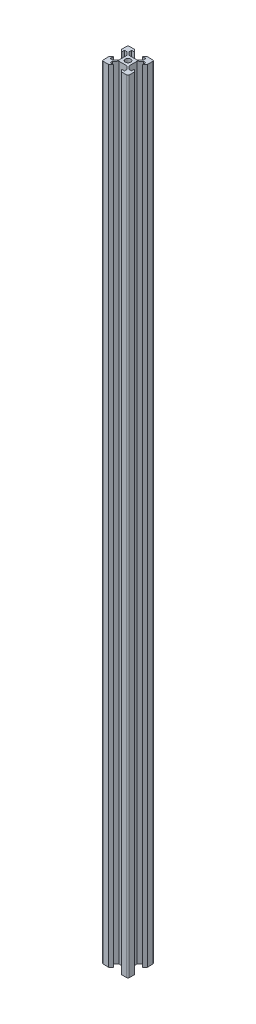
ISO-10303-21;
HEADER;
FILE_DESCRIPTION(('STEP AP214'),'2;1');
FILE_NAME('part.step','',(''),(''),'','','');
FILE_SCHEMA(('AUTOMOTIVE_DESIGN { 1 0 10303 214 1 1 1 1 }'));
ENDSEC;
DATA;
#1=APPLICATION_CONTEXT('core data for automotive mechanical design processes');
#2=APPLICATION_PROTOCOL_DEFINITION('international standard','automotive_design',2000,#1);
#3=PRODUCT_CONTEXT('',#1,'mechanical');
#4=PRODUCT('Part','Part','',(#3));
#5=PRODUCT_RELATED_PRODUCT_CATEGORY('part','',(#4));
#6=PRODUCT_DEFINITION_FORMATION('','',#4);
#7=PRODUCT_DEFINITION_CONTEXT('part definition',#1,'design');
#8=PRODUCT_DEFINITION('design','',#6,#7);
#9=PRODUCT_DEFINITION_SHAPE('','',#8);
#10=(LENGTH_UNIT() NAMED_UNIT(*) SI_UNIT(.MILLI.,.METRE.));
#11=(NAMED_UNIT(*) PLANE_ANGLE_UNIT() SI_UNIT($,.RADIAN.));
#12=(NAMED_UNIT(*) SI_UNIT($,.STERADIAN.) SOLID_ANGLE_UNIT());
#13=UNCERTAINTY_MEASURE_WITH_UNIT(LENGTH_MEASURE(1.E-05),#10,'distance_accuracy_value','');
#14=(GEOMETRIC_REPRESENTATION_CONTEXT(3) GLOBAL_UNCERTAINTY_ASSIGNED_CONTEXT((#13)) GLOBAL_UNIT_ASSIGNED_CONTEXT((#10,
#11,#12)) REPRESENTATION_CONTEXT('',''));
#15=CARTESIAN_POINT('',(0.,0.,0.));
#16=DIRECTION('',(0.,0.,1.));
#17=DIRECTION('',(1.,0.,0.));
#18=AXIS2_PLACEMENT_3D('',#15,#16,#17);
#19=CARTESIAN_POINT('',(-3.28302552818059,600.,-3.31061397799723));
#20=DIRECTION('',(-0.70414201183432,0.,-0.710059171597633));
#21=DIRECTION('',(-0.710059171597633,0.,0.70414201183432));
#22=AXIS2_PLACEMENT_3D('',#19,#20,#21);
#23=PLANE('',#22);
#24=DIRECTION('',(0.710059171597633,0.,-0.70414201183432));
#25=VECTOR('',#24,1.);
#26=CARTESIAN_POINT('',(-3.28302552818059,0.,-3.31061397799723));
#27=LINE('',#26,#25);
#28=CARTESIAN_POINT('',(-9.59579506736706,0.,2.94954914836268));
#29=VERTEX_POINT('',#28);
#30=CARTESIAN_POINT('',(-7.79579506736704,0.,1.16454914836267));
#31=VERTEX_POINT('',#30);
#32=EDGE_CURVE('E353',#29,#31,#27,.T.);
#33=ORIENTED_EDGE('',*,*,#32,.F.);
#34=DIRECTION('',(0.,-1.,0.));
#35=VECTOR('',#34,1.);
#36=CARTESIAN_POINT('',(-9.59579506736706,600.,2.94954914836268));
#37=LINE('',#36,#35);
#38=CARTESIAN_POINT('',(-9.59579506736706,600.,2.94954914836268));
#39=VERTEX_POINT('',#38);
#40=EDGE_CURVE('E348',#39,#29,#37,.T.);
#41=ORIENTED_EDGE('',*,*,#40,.F.);
#42=DIRECTION('',(0.710059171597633,0.,-0.70414201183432));
#43=VECTOR('',#42,1.);
#44=CARTESIAN_POINT('',(-3.28302552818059,600.,-3.31061397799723));
#45=LINE('',#44,#43);
#46=CARTESIAN_POINT('',(-7.79579506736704,600.,1.16454914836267));
#47=VERTEX_POINT('',#46);
#48=EDGE_CURVE('E351',#39,#47,#45,.T.);
#49=ORIENTED_EDGE('',*,*,#48,.T.);
#50=DIRECTION('',(0.,-1.,0.));
#51=VECTOR('',#50,1.);
#52=CARTESIAN_POINT('',(-7.79579506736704,600.,1.16454914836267));
#53=LINE('',#52,#51);
#54=EDGE_CURVE('E479',#47,#31,#53,.T.);
#55=ORIENTED_EDGE('',*,*,#54,.T.);
#56=EDGE_LOOP('',(#33,#41,#49,#55));
#57=FACE_BOUND('',#56,.T.);
#58=ADVANCED_FACE('F44',(#57),#23,.T.);
#59=CARTESIAN_POINT('',(-9.59579506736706,600.,0.));
#60=DIRECTION('',(1.,0.,0.));
#61=DIRECTION('',(0.,0.,-1.));
#62=AXIS2_PLACEMENT_3D('',#59,#60,#61);
#63=PLANE('',#62);
#64=DIRECTION('',(0.,0.,1.));
#65=VECTOR('',#64,1.);
#66=CARTESIAN_POINT('',(-9.59579506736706,0.,0.));
#67=LINE('',#66,#65);
#68=CARTESIAN_POINT('',(-9.59579506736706,0.,7.09954914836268));
#69=VERTEX_POINT('',#68);
#70=EDGE_CURVE('E484',#29,#69,#67,.T.);
#71=ORIENTED_EDGE('',*,*,#70,.T.);
#72=DIRECTION('',(0.,-1.,0.));
#73=VECTOR('',#72,1.);
#74=CARTESIAN_POINT('',(-9.59579506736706,600.,7.09954914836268));
#75=LINE('',#74,#73);
#76=CARTESIAN_POINT('',(-9.59579506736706,600.,7.09954914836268));
#77=VERTEX_POINT('',#76);
#78=EDGE_CURVE('E364',#69,#77,#75,.F.);
#79=ORIENTED_EDGE('',*,*,#78,.T.);
#80=DIRECTION('',(0.,0.,1.));
#81=VECTOR('',#80,1.);
#82=CARTESIAN_POINT('',(-9.59579506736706,600.,0.));
#83=LINE('',#82,#81);
#84=EDGE_CURVE('E361',#39,#77,#83,.T.);
#85=ORIENTED_EDGE('',*,*,#84,.F.);
#86=ORIENTED_EDGE('',*,*,#40,.T.);
#87=EDGE_LOOP('',(#71,#79,#85,#86));
#88=FACE_BOUND('',#87,.T.);
#89=ADVANCED_FACE('F362',(#88),#63,.F.);
#90=CARTESIAN_POINT('',(0.,600.,8.09954914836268));
#91=DIRECTION('',(0.,0.,-1.));
#92=DIRECTION('',(-1.,0.,0.));
#93=AXIS2_PLACEMENT_3D('',#90,#91,#92);
#94=PLANE('',#93);
#95=DIRECTION('',(1.,0.,0.));
#96=VECTOR('',#95,1.);
#97=CARTESIAN_POINT('',(0.,600.,8.09954914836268));
#98=LINE('',#97,#96);
#99=CARTESIAN_POINT('',(-8.59579506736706,600.,8.09954914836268));
#100=VERTEX_POINT('',#99);
#101=CARTESIAN_POINT('',(-4.44579506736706,600.,8.09954914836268));
#102=VERTEX_POINT('',#101);
#103=EDGE_CURVE('E366',#100,#102,#98,.T.);
#104=ORIENTED_EDGE('',*,*,#103,.F.);
#105=DIRECTION('',(0.,-1.,0.));
#106=VECTOR('',#105,1.);
#107=CARTESIAN_POINT('',(-8.59579506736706,600.,8.09954914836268));
#108=LINE('',#107,#106);
#109=CARTESIAN_POINT('',(-8.59579506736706,0.,8.09954914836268));
#110=VERTEX_POINT('',#109);
#111=EDGE_CURVE('E703',#100,#110,#108,.T.);
#112=ORIENTED_EDGE('',*,*,#111,.T.);
#113=DIRECTION('',(1.,0.,0.));
#114=VECTOR('',#113,1.);
#115=CARTESIAN_POINT('',(0.,0.,8.09954914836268));
#116=LINE('',#115,#114);
#117=CARTESIAN_POINT('',(-4.44579506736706,0.,8.09954914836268));
#118=VERTEX_POINT('',#117);
#119=EDGE_CURVE('E486',#110,#118,#116,.T.);
#120=ORIENTED_EDGE('',*,*,#119,.T.);
#121=DIRECTION('',(0.,-1.,0.));
#122=VECTOR('',#121,1.);
#123=CARTESIAN_POINT('',(-4.44579506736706,600.,8.09954914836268));
#124=LINE('',#123,#122);
#125=EDGE_CURVE('E358',#102,#118,#124,.T.);
#126=ORIENTED_EDGE('',*,*,#125,.F.);
#127=EDGE_LOOP('',(#104,#112,#120,#126));
#128=FACE_BOUND('',#127,.T.);
#129=ADVANCED_FACE('F868',(#128),#94,.F.);
#130=CARTESIAN_POINT('',(1.80813391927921,600.,1.79306613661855));
#131=DIRECTION('',(-0.710059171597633,0.,-0.70414201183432));
#132=DIRECTION('',(-0.70414201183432,0.,0.710059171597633));
#133=AXIS2_PLACEMENT_3D('',#130,#131,#132);
#134=PLANE('',#133);
#135=DIRECTION('',(0.70414201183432,0.,-0.710059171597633));
#136=VECTOR('',#135,1.);
#137=CARTESIAN_POINT('',(1.80813391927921,0.,1.79306613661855));
#138=LINE('',#137,#136);
#139=CARTESIAN_POINT('',(-2.66079506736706,0.,6.29954914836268));
#140=VERTEX_POINT('',#139);
#141=EDGE_CURVE('E489',#118,#140,#138,.T.);
#142=ORIENTED_EDGE('',*,*,#141,.T.);
#143=DIRECTION('',(0.,-1.,0.));
#144=VECTOR('',#143,1.);
#145=CARTESIAN_POINT('',(-2.66079506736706,600.,6.29954914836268));
#146=LINE('',#145,#144);
#147=CARTESIAN_POINT('',(-2.66079506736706,600.,6.29954914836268));
#148=VERTEX_POINT('',#147);
#149=EDGE_CURVE('E680',#148,#140,#146,.T.);
#150=ORIENTED_EDGE('',*,*,#149,.F.);
#151=DIRECTION('',(0.70414201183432,0.,-0.710059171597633));
#152=VECTOR('',#151,1.);
#153=CARTESIAN_POINT('',(1.80813391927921,600.,1.79306613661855));
#154=LINE('',#153,#152);
#155=EDGE_CURVE('E382',#102,#148,#154,.T.);
#156=ORIENTED_EDGE('',*,*,#155,.F.);
#157=ORIENTED_EDGE('',*,*,#125,.T.);
#158=EDGE_LOOP('',(#142,#150,#156,#157));
#159=FACE_BOUND('',#158,.T.);
#160=ADVANCED_FACE('F863',(#159),#134,.F.);
#161=CARTESIAN_POINT('',(0.,600.,6.29954914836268));
#162=DIRECTION('',(0.,0.,-1.));
#163=DIRECTION('',(-1.,0.,0.));
#164=AXIS2_PLACEMENT_3D('',#161,#162,#163);
#165=PLANE('',#164);
#166=DIRECTION('',(1.,0.,0.));
#167=VECTOR('',#166,1.);
#168=CARTESIAN_POINT('',(0.,0.,6.29954914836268));
#169=LINE('',#168,#167);
#170=CARTESIAN_POINT('',(-5.08762180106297,0.,6.29954914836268));
#171=VERTEX_POINT('',#170);
#172=EDGE_CURVE('E493',#171,#140,#169,.T.);
#173=ORIENTED_EDGE('',*,*,#172,.F.);
#174=DIRECTION('',(0.,-1.,0.));
#175=VECTOR('',#174,1.);
#176=CARTESIAN_POINT('',(-5.08762180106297,600.,6.29954914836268));
#177=LINE('',#176,#175);
#178=CARTESIAN_POINT('',(-5.08762180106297,600.,6.29954914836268));
#179=VERTEX_POINT('',#178);
#180=EDGE_CURVE('E678',#179,#171,#177,.T.);
#181=ORIENTED_EDGE('',*,*,#180,.F.);
#182=DIRECTION('',(1.,0.,0.));
#183=VECTOR('',#182,1.);
#184=CARTESIAN_POINT('',(0.,600.,6.29954914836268));
#185=LINE('',#184,#183);
#186=EDGE_CURVE('E385',#179,#148,#185,.T.);
#187=ORIENTED_EDGE('',*,*,#186,.T.);
#188=ORIENTED_EDGE('',*,*,#149,.T.);
#189=EDGE_LOOP('',(#173,#181,#187,#188));
#190=FACE_BOUND('',#189,.T.);
#191=ADVANCED_FACE('F858',(#190),#165,.T.);
#192=CARTESIAN_POINT('',(-5.08762180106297,600.,0.));
#193=DIRECTION('',(-1.,0.,0.));
#194=DIRECTION('',(0.,0.,1.));
#195=AXIS2_PLACEMENT_3D('',#192,#193,#194);
#196=PLANE('',#195);
#197=DIRECTION('',(0.,0.,-1.));
#198=VECTOR('',#197,1.);
#199=CARTESIAN_POINT('',(-5.08762180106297,0.,0.));
#200=LINE('',#199,#198);
#201=CARTESIAN_POINT('',(-5.08762180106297,0.,4.51505466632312));
#202=VERTEX_POINT('',#201);
#203=EDGE_CURVE('E496',#171,#202,#200,.T.);
#204=ORIENTED_EDGE('',*,*,#203,.T.);
#205=DIRECTION('',(0.,-1.,0.));
#206=VECTOR('',#205,1.);
#207=CARTESIAN_POINT('',(-5.08762180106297,600.,4.51505466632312));
#208=LINE('',#207,#206);
#209=CARTESIAN_POINT('',(-5.08762180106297,600.,4.51505466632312));
#210=VERTEX_POINT('',#209);
#211=EDGE_CURVE('E676',#210,#202,#208,.T.);
#212=ORIENTED_EDGE('',*,*,#211,.F.);
#213=DIRECTION('',(0.,0.,-1.));
#214=VECTOR('',#213,1.);
#215=CARTESIAN_POINT('',(-5.08762180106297,600.,0.));
#216=LINE('',#215,#214);
#217=EDGE_CURVE('E388',#179,#210,#216,.T.);
#218=ORIENTED_EDGE('',*,*,#217,.F.);
#219=ORIENTED_EDGE('',*,*,#180,.T.);
#220=EDGE_LOOP('',(#204,#212,#218,#219));
#221=FACE_BOUND('',#220,.T.);
#222=ADVANCED_FACE('F854',(#221),#196,.F.);
#223=CARTESIAN_POINT('',(-0.378992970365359,600.,-0.365632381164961));
#224=DIRECTION('',(0.719678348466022,0.,0.694307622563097));
#225=DIRECTION('',(0.694307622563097,0.,-0.719678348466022));
#226=AXIS2_PLACEMENT_3D('',#223,#224,#225);
#227=PLANE('',#226);
#228=DIRECTION('',(-0.694307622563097,0.,0.719678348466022));
#229=VECTOR('',#228,1.);
#230=CARTESIAN_POINT('',(-0.378992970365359,0.,-0.365632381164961));
#231=LINE('',#230,#229);
#232=CARTESIAN_POINT('',(-2.66079506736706,0.,1.99954914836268));
#233=VERTEX_POINT('',#232);
#234=EDGE_CURVE('E499',#233,#202,#231,.T.);
#235=ORIENTED_EDGE('',*,*,#234,.F.);
#236=DIRECTION('',(0.,-1.,0.));
#237=VECTOR('',#236,1.);
#238=CARTESIAN_POINT('',(-2.66079506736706,600.,1.99954914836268));
#239=LINE('',#238,#237);
#240=CARTESIAN_POINT('',(-2.66079506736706,600.,1.99954914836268));
#241=VERTEX_POINT('',#240);
#242=EDGE_CURVE('E674',#241,#233,#239,.T.);
#243=ORIENTED_EDGE('',*,*,#242,.F.);
#244=DIRECTION('',(-0.694307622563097,0.,0.719678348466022));
#245=VECTOR('',#244,1.);
#246=CARTESIAN_POINT('',(-0.378992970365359,600.,-0.365632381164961));
#247=LINE('',#246,#245);
#248=EDGE_CURVE('E390',#241,#210,#247,.T.);
#249=ORIENTED_EDGE('',*,*,#248,.T.);
#250=ORIENTED_EDGE('',*,*,#211,.T.);
#251=EDGE_LOOP('',(#235,#243,#249,#250));
#252=FACE_BOUND('',#251,.T.);
#253=ADVANCED_FACE('F848',(#252),#227,.T.);
#254=CARTESIAN_POINT('',(0.,600.,1.99954914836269));
#255=DIRECTION('',(0.,0.,-1.));
#256=DIRECTION('',(-1.,0.,0.));
#257=AXIS2_PLACEMENT_3D('',#254,#255,#256);
#258=PLANE('',#257);
#259=DIRECTION('',(1.,0.,0.));
#260=VECTOR('',#259,1.);
#261=CARTESIAN_POINT('',(0.,0.,1.99954914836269));
#262=LINE('',#261,#260);
#263=CARTESIAN_POINT('',(3.46920493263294,0.,1.99954914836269));
#264=VERTEX_POINT('',#263);
#265=EDGE_CURVE('E502',#233,#264,#262,.T.);
#266=ORIENTED_EDGE('',*,*,#265,.T.);
#267=DIRECTION('',(0.,-1.,0.));
#268=VECTOR('',#267,1.);
#269=CARTESIAN_POINT('',(3.46920493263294,600.,1.99954914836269));
#270=LINE('',#269,#268);
#271=CARTESIAN_POINT('',(3.46920493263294,600.,1.99954914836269));
#272=VERTEX_POINT('',#271);
#273=EDGE_CURVE('E671',#272,#264,#270,.T.);
#274=ORIENTED_EDGE('',*,*,#273,.F.);
#275=DIRECTION('',(1.,0.,0.));
#276=VECTOR('',#275,1.);
#277=CARTESIAN_POINT('',(0.,600.,1.99954914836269));
#278=LINE('',#277,#276);
#279=EDGE_CURVE('E393',#241,#272,#278,.T.);
#280=ORIENTED_EDGE('',*,*,#279,.F.);
#281=ORIENTED_EDGE('',*,*,#242,.T.);
#282=EDGE_LOOP('',(#266,#274,#280,#281));
#283=FACE_BOUND('',#282,.T.);
#284=ADVANCED_FACE('F872',(#283),#258,.F.);
#285=CARTESIAN_POINT('',(0.791758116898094,600.,-0.766418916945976));
#286=DIRECTION('',(0.718510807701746,0.,-0.695515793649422));
#287=DIRECTION('',(-0.695515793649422,0.,-0.718510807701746));
#288=AXIS2_PLACEMENT_3D('',#285,#286,#287);
#289=PLANE('',#288);
#290=DIRECTION('',(0.695515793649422,0.,0.718510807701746));
#291=VECTOR('',#290,1.);
#292=CARTESIAN_POINT('',(0.791758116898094,0.,-0.766418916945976));
#293=LINE('',#292,#291);
#294=CARTESIAN_POINT('',(5.90420493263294,0.,4.51505466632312));
#295=VERTEX_POINT('',#294);
#296=EDGE_CURVE('E505',#264,#295,#293,.T.);
#297=ORIENTED_EDGE('',*,*,#296,.T.);
#298=DIRECTION('',(0.,-1.,0.));
#299=VECTOR('',#298,1.);
#300=CARTESIAN_POINT('',(5.90420493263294,600.,4.51505466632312));
#301=LINE('',#300,#299);
#302=CARTESIAN_POINT('',(5.90420493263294,600.,4.51505466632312));
#303=VERTEX_POINT('',#302);
#304=EDGE_CURVE('E669',#303,#295,#301,.T.);
#305=ORIENTED_EDGE('',*,*,#304,.F.);
#306=DIRECTION('',(0.695515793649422,0.,0.718510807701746));
#307=VECTOR('',#306,1.);
#308=CARTESIAN_POINT('',(0.791758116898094,600.,-0.766418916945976));
#309=LINE('',#308,#307);
#310=EDGE_CURVE('E396',#272,#303,#309,.T.);
#311=ORIENTED_EDGE('',*,*,#310,.F.);
#312=ORIENTED_EDGE('',*,*,#273,.T.);
#313=EDGE_LOOP('',(#297,#305,#311,#312));
#314=FACE_BOUND('',#313,.T.);
#315=ADVANCED_FACE('F841',(#314),#289,.F.);
#316=CARTESIAN_POINT('',(5.90420493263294,600.,0.));
#317=DIRECTION('',(-1.,0.,0.));
#318=DIRECTION('',(0.,0.,1.));
#319=AXIS2_PLACEMENT_3D('',#316,#317,#318);
#320=PLANE('',#319);
#321=DIRECTION('',(0.,0.,-1.));
#322=VECTOR('',#321,1.);
#323=CARTESIAN_POINT('',(5.90420493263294,0.,0.));
#324=LINE('',#323,#322);
#325=CARTESIAN_POINT('',(5.90420493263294,0.,6.29954914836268));
#326=VERTEX_POINT('',#325);
#327=EDGE_CURVE('E508',#326,#295,#324,.T.);
#328=ORIENTED_EDGE('',*,*,#327,.F.);
#329=DIRECTION('',(0.,-1.,0.));
#330=VECTOR('',#329,1.);
#331=CARTESIAN_POINT('',(5.90420493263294,600.,6.29954914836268));
#332=LINE('',#331,#330);
#333=CARTESIAN_POINT('',(5.90420493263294,600.,6.29954914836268));
#334=VERTEX_POINT('',#333);
#335=EDGE_CURVE('E667',#334,#326,#332,.T.);
#336=ORIENTED_EDGE('',*,*,#335,.F.);
#337=DIRECTION('',(0.,0.,-1.));
#338=VECTOR('',#337,1.);
#339=CARTESIAN_POINT('',(5.90420493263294,600.,0.));
#340=LINE('',#339,#338);
#341=EDGE_CURVE('E398',#334,#303,#340,.T.);
#342=ORIENTED_EDGE('',*,*,#341,.T.);
#343=ORIENTED_EDGE('',*,*,#304,.T.);
#344=EDGE_LOOP('',(#328,#336,#342,#343));
#345=FACE_BOUND('',#344,.T.);
#346=ADVANCED_FACE('F836',(#345),#320,.T.);
#347=CARTESIAN_POINT('',(0.,600.,6.29954914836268));
#348=DIRECTION('',(0.,0.,1.));
#349=DIRECTION('',(1.,0.,0.));
#350=AXIS2_PLACEMENT_3D('',#347,#348,#349);
#351=PLANE('',#350);
#352=DIRECTION('',(-1.,0.,0.));
#353=VECTOR('',#352,1.);
#354=CARTESIAN_POINT('',(0.,0.,6.29954914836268));
#355=LINE('',#354,#353);
#356=CARTESIAN_POINT('',(3.46920493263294,0.,6.29954914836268));
#357=VERTEX_POINT('',#356);
#358=EDGE_CURVE('E511',#326,#357,#355,.T.);
#359=ORIENTED_EDGE('',*,*,#358,.T.);
#360=DIRECTION('',(0.,-1.,0.));
#361=VECTOR('',#360,1.);
#362=CARTESIAN_POINT('',(3.46920493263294,600.,6.29954914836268));
#363=LINE('',#362,#361);
#364=CARTESIAN_POINT('',(3.46920493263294,600.,6.29954914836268));
#365=VERTEX_POINT('',#364);
#366=EDGE_CURVE('E665',#365,#357,#363,.T.);
#367=ORIENTED_EDGE('',*,*,#366,.F.);
#368=DIRECTION('',(-1.,0.,0.));
#369=VECTOR('',#368,1.);
#370=CARTESIAN_POINT('',(0.,600.,6.29954914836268));
#371=LINE('',#370,#369);
#372=EDGE_CURVE('E401',#334,#365,#371,.T.);
#373=ORIENTED_EDGE('',*,*,#372,.F.);
#374=ORIENTED_EDGE('',*,*,#335,.T.);
#375=EDGE_LOOP('',(#359,#367,#373,#374));
#376=FACE_BOUND('',#375,.T.);
#377=ADVANCED_FACE('F1135',(#376),#351,.F.);
#378=CARTESIAN_POINT('',(-1.40054657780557,600.,1.38887535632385));
#379=DIRECTION('',(-0.710059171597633,0.,0.70414201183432));
#380=DIRECTION('',(0.70414201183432,0.,0.710059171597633));
#381=AXIS2_PLACEMENT_3D('',#378,#379,#380);
#382=PLANE('',#381);
#383=DIRECTION('',(-0.70414201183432,0.,-0.710059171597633));
#384=VECTOR('',#383,1.);
#385=CARTESIAN_POINT('',(-1.40054657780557,0.,1.38887535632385));
#386=LINE('',#385,#384);
#387=CARTESIAN_POINT('',(5.25420493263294,0.,8.09954914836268));
#388=VERTEX_POINT('',#387);
#389=EDGE_CURVE('E514',#388,#357,#386,.T.);
#390=ORIENTED_EDGE('',*,*,#389,.F.);
#391=DIRECTION('',(0.,-1.,0.));
#392=VECTOR('',#391,1.);
#393=CARTESIAN_POINT('',(5.25420493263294,600.,8.09954914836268));
#394=LINE('',#393,#392);
#395=CARTESIAN_POINT('',(5.25420493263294,600.,8.09954914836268));
#396=VERTEX_POINT('',#395);
#397=EDGE_CURVE('E663',#396,#388,#394,.T.);
#398=ORIENTED_EDGE('',*,*,#397,.F.);
#399=DIRECTION('',(-0.70414201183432,0.,-0.710059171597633));
#400=VECTOR('',#399,1.);
#401=CARTESIAN_POINT('',(-1.40054657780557,600.,1.38887535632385));
#402=LINE('',#401,#400);
#403=EDGE_CURVE('E403',#396,#365,#402,.T.);
#404=ORIENTED_EDGE('',*,*,#403,.T.);
#405=ORIENTED_EDGE('',*,*,#366,.T.);
#406=EDGE_LOOP('',(#390,#398,#404,#405));
#407=FACE_BOUND('',#406,.T.);
#408=ADVANCED_FACE('F830',(#407),#382,.T.);
#409=CARTESIAN_POINT('',(9.40420493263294,0.,8.09954914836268));
#410=VERTEX_POINT('',#409);
#411=EDGE_CURVE('E490',#388,#410,#116,.T.);
#412=ORIENTED_EDGE('',*,*,#411,.T.);
#413=DIRECTION('',(0.,-1.,0.));
#414=VECTOR('',#413,1.);
#415=CARTESIAN_POINT('',(9.40420493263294,600.,8.09954914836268));
#416=LINE('',#415,#414);
#417=CARTESIAN_POINT('',(9.40420493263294,600.,8.09954914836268));
#418=VERTEX_POINT('',#417);
#419=EDGE_CURVE('E694',#410,#418,#416,.F.);
#420=ORIENTED_EDGE('',*,*,#419,.T.);
#421=EDGE_CURVE('E383',#396,#418,#98,.T.);
#422=ORIENTED_EDGE('',*,*,#421,.F.);
#423=ORIENTED_EDGE('',*,*,#397,.T.);
#424=EDGE_LOOP('',(#412,#420,#422,#423));
#425=FACE_BOUND('',#424,.T.);
#426=ADVANCED_FACE('F826',(#425),#94,.F.);
#427=CARTESIAN_POINT('',(10.4042049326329,600.,0.));
#428=DIRECTION('',(1.,0.,0.));
#429=DIRECTION('',(0.,0.,-1.));
#430=AXIS2_PLACEMENT_3D('',#427,#428,#429);
#431=PLANE('',#430);
#432=DIRECTION('',(0.,0.,1.));
#433=VECTOR('',#432,1.);
#434=CARTESIAN_POINT('',(10.4042049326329,600.,0.));
#435=LINE('',#434,#433);
#436=CARTESIAN_POINT('',(10.4042049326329,600.,2.94954914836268));
#437=VERTEX_POINT('',#436);
#438=CARTESIAN_POINT('',(10.4042049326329,600.,7.09954914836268));
#439=VERTEX_POINT('',#438);
#440=EDGE_CURVE('E406',#437,#439,#435,.T.);
#441=ORIENTED_EDGE('',*,*,#440,.T.);
#442=DIRECTION('',(0.,-1.,0.));
#443=VECTOR('',#442,1.);
#444=CARTESIAN_POINT('',(10.4042049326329,0.,7.09954914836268));
#445=LINE('',#444,#443);
#446=CARTESIAN_POINT('',(10.4042049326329,0.,7.09954914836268));
#447=VERTEX_POINT('',#446);
#448=EDGE_CURVE('E357',#439,#447,#445,.T.);
#449=ORIENTED_EDGE('',*,*,#448,.T.);
#450=DIRECTION('',(0.,0.,1.));
#451=VECTOR('',#450,1.);
#452=CARTESIAN_POINT('',(10.4042049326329,0.,0.));
#453=LINE('',#452,#451);
#454=CARTESIAN_POINT('',(10.4042049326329,0.,2.94954914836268));
#455=VERTEX_POINT('',#454);
#456=EDGE_CURVE('E517',#455,#447,#453,.T.);
#457=ORIENTED_EDGE('',*,*,#456,.F.);
#458=DIRECTION('',(0.,-1.,0.));
#459=VECTOR('',#458,1.);
#460=CARTESIAN_POINT('',(10.4042049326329,600.,2.94954914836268));
#461=LINE('',#460,#459);
#462=EDGE_CURVE('E661',#437,#455,#461,.T.);
#463=ORIENTED_EDGE('',*,*,#462,.F.);
#464=EDGE_LOOP('',(#441,#449,#457,#463));
#465=FACE_BOUND('',#464,.T.);
#466=ADVANCED_FACE('F815',(#465),#431,.T.);
#467=CARTESIAN_POINT('',(3.68384805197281,600.,-3.71480475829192));
#468=DIRECTION('',(-0.704142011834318,0.,0.710059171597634));
#469=DIRECTION('',(0.710059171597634,0.,0.704142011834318));
#470=AXIS2_PLACEMENT_3D('',#467,#468,#469);
#471=PLANE('',#470);
#472=DIRECTION('',(-0.710059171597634,0.,-0.704142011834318));
#473=VECTOR('',#472,1.);
#474=CARTESIAN_POINT('',(3.68384805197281,0.,-3.71480475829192));
#475=LINE('',#474,#473);
#476=CARTESIAN_POINT('',(8.60420493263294,0.,1.16454914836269));
#477=VERTEX_POINT('',#476);
#478=EDGE_CURVE('E520',#455,#477,#475,.T.);
#479=ORIENTED_EDGE('',*,*,#478,.T.);
#480=DIRECTION('',(0.,-1.,0.));
#481=VECTOR('',#480,1.);
#482=CARTESIAN_POINT('',(8.60420493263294,600.,1.16454914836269));
#483=LINE('',#482,#481);
#484=CARTESIAN_POINT('',(8.60420493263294,600.,1.16454914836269));
#485=VERTEX_POINT('',#484);
#486=EDGE_CURVE('E659',#485,#477,#483,.T.);
#487=ORIENTED_EDGE('',*,*,#486,.F.);
#488=DIRECTION('',(-0.710059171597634,0.,-0.704142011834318));
#489=VECTOR('',#488,1.);
#490=CARTESIAN_POINT('',(3.68384805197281,600.,-3.71480475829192));
#491=LINE('',#490,#489);
#492=EDGE_CURVE('E409',#437,#485,#491,.T.);
#493=ORIENTED_EDGE('',*,*,#492,.F.);
#494=ORIENTED_EDGE('',*,*,#462,.T.);
#495=EDGE_LOOP('',(#479,#487,#493,#494));
#496=FACE_BOUND('',#495,.T.);
#497=ADVANCED_FACE('F812',(#496),#471,.F.);
#498=CARTESIAN_POINT('',(8.60420493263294,600.,0.));
#499=DIRECTION('',(-1.,0.,0.));
#500=DIRECTION('',(0.,0.,1.));
#501=AXIS2_PLACEMENT_3D('',#498,#499,#500);
#502=PLANE('',#501);
#503=DIRECTION('',(0.,0.,-1.));
#504=VECTOR('',#503,1.);
#505=CARTESIAN_POINT('',(8.60420493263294,0.,0.));
#506=LINE('',#505,#504);
#507=CARTESIAN_POINT('',(8.60420493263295,0.,3.5913758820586));
#508=VERTEX_POINT('',#507);
#509=EDGE_CURVE('E524',#508,#477,#506,.T.);
#510=ORIENTED_EDGE('',*,*,#509,.F.);
#511=DIRECTION('',(0.,-1.,0.));
#512=VECTOR('',#511,1.);
#513=CARTESIAN_POINT('',(8.60420493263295,600.,3.5913758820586));
#514=LINE('',#513,#512);
#515=CARTESIAN_POINT('',(8.60420493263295,600.,3.5913758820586));
#516=VERTEX_POINT('',#515);
#517=EDGE_CURVE('E657',#516,#508,#514,.T.);
#518=ORIENTED_EDGE('',*,*,#517,.F.);
#519=DIRECTION('',(0.,0.,-1.));
#520=VECTOR('',#519,1.);
#521=CARTESIAN_POINT('',(8.60420493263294,600.,0.));
#522=LINE('',#521,#520);
#523=EDGE_CURVE('E412',#516,#485,#522,.T.);
#524=ORIENTED_EDGE('',*,*,#523,.T.);
#525=ORIENTED_EDGE('',*,*,#486,.T.);
#526=EDGE_LOOP('',(#510,#518,#524,#525));
#527=FACE_BOUND('',#526,.T.);
#528=ADVANCED_FACE('F807',(#527),#502,.T.);
#529=CARTESIAN_POINT('',(0.,600.,3.59137588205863));
#530=DIRECTION('',(0.,0.,1.));
#531=DIRECTION('',(1.,0.,0.));
#532=AXIS2_PLACEMENT_3D('',#529,#530,#531);
#533=PLANE('',#532);
#534=DIRECTION('',(-1.,0.,0.));
#535=VECTOR('',#534,1.);
#536=CARTESIAN_POINT('',(0.,0.,3.59137588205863));
#537=LINE('',#536,#535);
#538=CARTESIAN_POINT('',(6.81971045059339,0.,3.5913758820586));
#539=VERTEX_POINT('',#538);
#540=EDGE_CURVE('E527',#508,#539,#537,.T.);
#541=ORIENTED_EDGE('',*,*,#540,.T.);
#542=DIRECTION('',(0.,-1.,0.));
#543=VECTOR('',#542,1.);
#544=CARTESIAN_POINT('',(6.81971045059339,600.,3.5913758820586));
#545=LINE('',#544,#543);
#546=CARTESIAN_POINT('',(6.81971045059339,600.,3.5913758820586));
#547=VERTEX_POINT('',#546);
#548=EDGE_CURVE('E655',#547,#539,#545,.T.);
#549=ORIENTED_EDGE('',*,*,#548,.F.);
#550=DIRECTION('',(-1.,0.,0.));
#551=VECTOR('',#550,1.);
#552=CARTESIAN_POINT('',(0.,600.,3.59137588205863));
#553=LINE('',#552,#551);
#554=EDGE_CURVE('E415',#516,#547,#553,.T.);
#555=ORIENTED_EDGE('',*,*,#554,.F.);
#556=ORIENTED_EDGE('',*,*,#517,.T.);
#557=EDGE_LOOP('',(#541,#549,#555,#556));
#558=FACE_BOUND('',#557,.T.);
#559=ADVANCED_FACE('F803',(#558),#533,.F.);
#560=CARTESIAN_POINT('',(1.49299848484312,600.,-1.54755420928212));
#561=DIRECTION('',(0.694307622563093,0.,-0.719678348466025));
#562=DIRECTION('',(-0.719678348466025,0.,-0.694307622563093));
#563=AXIS2_PLACEMENT_3D('',#560,#561,#562);
#564=PLANE('',#563);
#565=DIRECTION('',(0.719678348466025,0.,0.694307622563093));
#566=VECTOR('',#565,1.);
#567=CARTESIAN_POINT('',(1.49299848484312,0.,-1.54755420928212));
#568=LINE('',#567,#566);
#569=CARTESIAN_POINT('',(4.30420493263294,0.,1.16454914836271));
#570=VERTEX_POINT('',#569);
#571=EDGE_CURVE('E530',#570,#539,#568,.T.);
#572=ORIENTED_EDGE('',*,*,#571,.F.);
#573=DIRECTION('',(0.,-1.,0.));
#574=VECTOR('',#573,1.);
#575=CARTESIAN_POINT('',(4.30420493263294,600.,1.16454914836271));
#576=LINE('',#575,#574);
#577=CARTESIAN_POINT('',(4.30420493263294,600.,1.16454914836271));
#578=VERTEX_POINT('',#577);
#579=EDGE_CURVE('E653',#578,#570,#576,.T.);
#580=ORIENTED_EDGE('',*,*,#579,.F.);
#581=DIRECTION('',(0.719678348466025,0.,0.694307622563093));
#582=VECTOR('',#581,1.);
#583=CARTESIAN_POINT('',(1.49299848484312,600.,-1.54755420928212));
#584=LINE('',#583,#582);
#585=EDGE_CURVE('E417',#578,#547,#584,.T.);
#586=ORIENTED_EDGE('',*,*,#585,.T.);
#587=ORIENTED_EDGE('',*,*,#548,.T.);
#588=EDGE_LOOP('',(#572,#580,#586,#587));
#589=FACE_BOUND('',#588,.T.);
#590=ADVANCED_FACE('F797',(#589),#564,.T.);
#591=CARTESIAN_POINT('',(4.30420493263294,600.,0.));
#592=DIRECTION('',(-1.,0.,0.));
#593=DIRECTION('',(0.,0.,1.));
#594=AXIS2_PLACEMENT_3D('',#591,#592,#593);
#595=PLANE('',#594);
#596=DIRECTION('',(0.,0.,-1.));
#597=VECTOR('',#596,1.);
#598=CARTESIAN_POINT('',(4.30420493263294,0.,0.));
#599=LINE('',#598,#597);
#600=CARTESIAN_POINT('',(4.30420493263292,0.,-4.96545085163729));
#601=VERTEX_POINT('',#600);
#602=EDGE_CURVE('E533',#570,#601,#599,.T.);
#603=ORIENTED_EDGE('',*,*,#602,.T.);
#604=DIRECTION('',(0.,-1.,0.));
#605=VECTOR('',#604,1.);
#606=CARTESIAN_POINT('',(4.30420493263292,600.,-4.96545085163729));
#607=LINE('',#606,#605);
#608=CARTESIAN_POINT('',(4.30420493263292,600.,-4.96545085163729));
#609=VERTEX_POINT('',#608);
#610=EDGE_CURVE('E650',#609,#601,#607,.T.);
#611=ORIENTED_EDGE('',*,*,#610,.F.);
#612=DIRECTION('',(0.,0.,-1.));
#613=VECTOR('',#612,1.);
#614=CARTESIAN_POINT('',(4.30420493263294,600.,0.));
#615=LINE('',#614,#613);
#616=EDGE_CURVE('E420',#578,#609,#615,.T.);
#617=ORIENTED_EDGE('',*,*,#616,.F.);
#618=ORIENTED_EDGE('',*,*,#579,.T.);
#619=EDGE_LOOP('',(#603,#611,#617,#618));
#620=FACE_BOUND('',#619,.T.);
#621=ADVANCED_FACE('F1182',(#620),#595,.F.);
#622=CARTESIAN_POINT('',(-0.39928698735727,600.,-0.412488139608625));
#623=DIRECTION('',(-0.695515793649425,0.,-0.718510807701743));
#624=DIRECTION('',(-0.718510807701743,0.,0.695515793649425));
#625=AXIS2_PLACEMENT_3D('',#622,#623,#624);
#626=PLANE('',#625);
#627=DIRECTION('',(0.718510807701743,0.,-0.695515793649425));
#628=VECTOR('',#627,1.);
#629=CARTESIAN_POINT('',(-0.39928698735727,0.,-0.412488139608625));
#630=LINE('',#629,#628);
#631=CARTESIAN_POINT('',(6.81971045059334,0.,-7.4004508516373));
#632=VERTEX_POINT('',#631);
#633=EDGE_CURVE('E536',#601,#632,#630,.T.);
#634=ORIENTED_EDGE('',*,*,#633,.T.);
#635=DIRECTION('',(0.,-1.,0.));
#636=VECTOR('',#635,1.);
#637=CARTESIAN_POINT('',(6.81971045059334,600.,-7.4004508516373));
#638=LINE('',#637,#636);
#639=CARTESIAN_POINT('',(6.81971045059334,600.,-7.4004508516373));
#640=VERTEX_POINT('',#639);
#641=EDGE_CURVE('E648',#640,#632,#638,.T.);
#642=ORIENTED_EDGE('',*,*,#641,.F.);
#643=DIRECTION('',(0.718510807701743,0.,-0.695515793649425));
#644=VECTOR('',#643,1.);
#645=CARTESIAN_POINT('',(-0.39928698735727,600.,-0.412488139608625));
#646=LINE('',#645,#644);
#647=EDGE_CURVE('E423',#609,#640,#646,.T.);
#648=ORIENTED_EDGE('',*,*,#647,.F.);
#649=ORIENTED_EDGE('',*,*,#610,.T.);
#650=EDGE_LOOP('',(#634,#642,#648,#649));
#651=FACE_BOUND('',#650,.T.);
#652=ADVANCED_FACE('F790',(#651),#626,.F.);
#653=CARTESIAN_POINT('',(0.,600.,-7.40045085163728));
#654=DIRECTION('',(0.,0.,1.));
#655=DIRECTION('',(1.,0.,0.));
#656=AXIS2_PLACEMENT_3D('',#653,#654,#655);
#657=PLANE('',#656);
#658=DIRECTION('',(-1.,0.,0.));
#659=VECTOR('',#658,1.);
#660=CARTESIAN_POINT('',(0.,0.,-7.40045085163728));
#661=LINE('',#660,#659);
#662=CARTESIAN_POINT('',(8.60420493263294,0.,-7.4004508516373));
#663=VERTEX_POINT('',#662);
#664=EDGE_CURVE('E539',#663,#632,#661,.T.);
#665=ORIENTED_EDGE('',*,*,#664,.F.);
#666=DIRECTION('',(0.,-1.,0.));
#667=VECTOR('',#666,1.);
#668=CARTESIAN_POINT('',(8.60420493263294,600.,-7.4004508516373));
#669=LINE('',#668,#667);
#670=CARTESIAN_POINT('',(8.60420493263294,600.,-7.4004508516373));
#671=VERTEX_POINT('',#670);
#672=EDGE_CURVE('E646',#671,#663,#669,.T.);
#673=ORIENTED_EDGE('',*,*,#672,.F.);
#674=DIRECTION('',(-1.,0.,0.));
#675=VECTOR('',#674,1.);
#676=CARTESIAN_POINT('',(0.,600.,-7.40045085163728));
#677=LINE('',#676,#675);
#678=EDGE_CURVE('E425',#671,#640,#677,.T.);
#679=ORIENTED_EDGE('',*,*,#678,.T.);
#680=ORIENTED_EDGE('',*,*,#641,.T.);
#681=EDGE_LOOP('',(#665,#673,#679,#680));
#682=FACE_BOUND('',#681,.T.);
#683=ADVANCED_FACE('F785',(#682),#657,.T.);
#684=CARTESIAN_POINT('',(8.60420493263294,600.,0.));
#685=DIRECTION('',(1.,0.,0.));
#686=DIRECTION('',(0.,0.,-1.));
#687=AXIS2_PLACEMENT_3D('',#684,#685,#686);
#688=PLANE('',#687);
#689=DIRECTION('',(0.,0.,1.));
#690=VECTOR('',#689,1.);
#691=CARTESIAN_POINT('',(8.60420493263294,0.,0.));
#692=LINE('',#691,#690);
#693=CARTESIAN_POINT('',(8.60420493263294,0.,-4.96545085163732));
#694=VERTEX_POINT('',#693);
#695=EDGE_CURVE('E542',#663,#694,#692,.T.);
#696=ORIENTED_EDGE('',*,*,#695,.T.);
#697=DIRECTION('',(0.,-1.,0.));
#698=VECTOR('',#697,1.);
#699=CARTESIAN_POINT('',(8.60420493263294,600.,-4.96545085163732));
#700=LINE('',#699,#698);
#701=CARTESIAN_POINT('',(8.60420493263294,600.,-4.96545085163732));
#702=VERTEX_POINT('',#701);
#703=EDGE_CURVE('E644',#702,#694,#700,.T.);
#704=ORIENTED_EDGE('',*,*,#703,.F.);
#705=DIRECTION('',(0.,0.,1.));
#706=VECTOR('',#705,1.);
#707=CARTESIAN_POINT('',(8.60420493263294,600.,0.));
#708=LINE('',#707,#706);
#709=EDGE_CURVE('E428',#671,#702,#708,.T.);
#710=ORIENTED_EDGE('',*,*,#709,.F.);
#711=ORIENTED_EDGE('',*,*,#672,.T.);
#712=EDGE_LOOP('',(#696,#704,#710,#711));
#713=FACE_BOUND('',#712,.T.);
#714=ADVANCED_FACE('F1204',(#713),#688,.F.);
#715=CARTESIAN_POINT('',(1.78346374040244,600.,1.79845083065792));
#716=DIRECTION('',(0.70414201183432,0.,0.710059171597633));
#717=DIRECTION('',(0.710059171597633,0.,-0.70414201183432));
#718=AXIS2_PLACEMENT_3D('',#715,#716,#717);
#719=PLANE('',#718);
#720=DIRECTION('',(-0.710059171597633,0.,0.70414201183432));
#721=VECTOR('',#720,1.);
#722=CARTESIAN_POINT('',(1.78346374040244,0.,1.79845083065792));
#723=LINE('',#722,#721);
#724=CARTESIAN_POINT('',(10.4042049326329,0.,-6.75045085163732));
#725=VERTEX_POINT('',#724);
#726=EDGE_CURVE('E545',#725,#694,#723,.T.);
#727=ORIENTED_EDGE('',*,*,#726,.F.);
#728=DIRECTION('',(0.,-1.,0.));
#729=VECTOR('',#728,1.);
#730=CARTESIAN_POINT('',(10.4042049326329,600.,-6.75045085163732));
#731=LINE('',#730,#729);
#732=CARTESIAN_POINT('',(10.4042049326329,600.,-6.75045085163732));
#733=VERTEX_POINT('',#732);
#734=EDGE_CURVE('E641',#733,#725,#731,.T.);
#735=ORIENTED_EDGE('',*,*,#734,.F.);
#736=DIRECTION('',(-0.710059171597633,0.,0.70414201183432));
#737=VECTOR('',#736,1.);
#738=CARTESIAN_POINT('',(1.78346374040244,600.,1.79845083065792));
#739=LINE('',#738,#737);
#740=EDGE_CURVE('E430',#733,#702,#739,.T.);
#741=ORIENTED_EDGE('',*,*,#740,.T.);
#742=ORIENTED_EDGE('',*,*,#703,.T.);
#743=EDGE_LOOP('',(#727,#735,#741,#742));
#744=FACE_BOUND('',#743,.T.);
#745=ADVANCED_FACE('F779',(#744),#719,.T.);
#746=CARTESIAN_POINT('',(10.4042049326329,0.,-10.9004508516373));
#747=VERTEX_POINT('',#746);
#748=EDGE_CURVE('E521',#747,#725,#453,.T.);
#749=ORIENTED_EDGE('',*,*,#748,.F.);
#750=DIRECTION('',(0.,-1.,0.));
#751=VECTOR('',#750,1.);
#752=CARTESIAN_POINT('',(10.4042049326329,600.,-10.9004508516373));
#753=LINE('',#752,#751);
#754=CARTESIAN_POINT('',(10.4042049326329,600.,-10.9004508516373));
#755=VERTEX_POINT('',#754);
#756=EDGE_CURVE('E710',#747,#755,#753,.F.);
#757=ORIENTED_EDGE('',*,*,#756,.T.);
#758=EDGE_CURVE('E410',#755,#733,#435,.T.);
#759=ORIENTED_EDGE('',*,*,#758,.T.);
#760=ORIENTED_EDGE('',*,*,#734,.T.);
#761=EDGE_LOOP('',(#749,#757,#759,#760));
#762=FACE_BOUND('',#761,.T.);
#763=ADVANCED_FACE('F773',(#762),#431,.T.);
#764=CARTESIAN_POINT('',(0.,600.,-11.9004508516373));
#765=DIRECTION('',(0.,0.,-1.));
#766=DIRECTION('',(-1.,0.,0.));
#767=AXIS2_PLACEMENT_3D('',#764,#765,#766);
#768=PLANE('',#767);
#769=DIRECTION('',(1.,0.,0.));
#770=VECTOR('',#769,1.);
#771=CARTESIAN_POINT('',(0.,600.,-11.9004508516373));
#772=LINE('',#771,#770);
#773=CARTESIAN_POINT('',(5.25420493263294,600.,-11.9004508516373));
#774=VERTEX_POINT('',#773);
#775=CARTESIAN_POINT('',(9.40420493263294,600.,-11.9004508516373));
#776=VERTEX_POINT('',#775);
#777=EDGE_CURVE('E433',#774,#776,#772,.T.);
#778=ORIENTED_EDGE('',*,*,#777,.T.);
#779=DIRECTION('',(0.,-1.,0.));
#780=VECTOR('',#779,1.);
#781=CARTESIAN_POINT('',(9.40420493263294,600.,-11.9004508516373));
#782=LINE('',#781,#780);
#783=CARTESIAN_POINT('',(9.40420493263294,0.,-11.9004508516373));
#784=VERTEX_POINT('',#783);
#785=EDGE_CURVE('E707',#776,#784,#782,.T.);
#786=ORIENTED_EDGE('',*,*,#785,.T.);
#787=DIRECTION('',(1.,0.,0.));
#788=VECTOR('',#787,1.);
#789=CARTESIAN_POINT('',(0.,0.,-11.9004508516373));
#790=LINE('',#789,#788);
#791=CARTESIAN_POINT('',(5.25420493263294,0.,-11.9004508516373));
#792=VERTEX_POINT('',#791);
#793=EDGE_CURVE('E548',#792,#784,#790,.T.);
#794=ORIENTED_EDGE('',*,*,#793,.F.);
#795=DIRECTION('',(0.,-1.,0.));
#796=VECTOR('',#795,1.);
#797=CARTESIAN_POINT('',(5.25420493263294,600.,-11.9004508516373));
#798=LINE('',#797,#796);
#799=EDGE_CURVE('E639',#774,#792,#798,.T.);
#800=ORIENTED_EDGE('',*,*,#799,.F.);
#801=EDGE_LOOP('',(#778,#786,#794,#800));
#802=FACE_BOUND('',#801,.T.);
#803=ADVANCED_FACE('F764',(#802),#768,.T.);
#804=CARTESIAN_POINT('',(-3.30093088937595,600.,-3.27342313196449));
#805=DIRECTION('',(0.710059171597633,0.,0.70414201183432));
#806=DIRECTION('',(0.70414201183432,0.,-0.710059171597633));
#807=AXIS2_PLACEMENT_3D('',#804,#805,#806);
#808=PLANE('',#807);
#809=DIRECTION('',(-0.70414201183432,0.,0.710059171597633));
#810=VECTOR('',#809,1.);
#811=CARTESIAN_POINT('',(-3.30093088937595,0.,-3.27342313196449));
#812=LINE('',#811,#810);
#813=CARTESIAN_POINT('',(3.46920493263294,0.,-10.1004508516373));
#814=VERTEX_POINT('',#813);
#815=EDGE_CURVE('E551',#792,#814,#812,.T.);
#816=ORIENTED_EDGE('',*,*,#815,.T.);
#817=DIRECTION('',(0.,-1.,0.));
#818=VECTOR('',#817,1.);
#819=CARTESIAN_POINT('',(3.46920493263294,600.,-10.1004508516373));
#820=LINE('',#819,#818);
#821=CARTESIAN_POINT('',(3.46920493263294,600.,-10.1004508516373));
#822=VERTEX_POINT('',#821);
#823=EDGE_CURVE('E637',#822,#814,#820,.T.);
#824=ORIENTED_EDGE('',*,*,#823,.F.);
#825=DIRECTION('',(-0.70414201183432,0.,0.710059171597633));
#826=VECTOR('',#825,1.);
#827=CARTESIAN_POINT('',(-3.30093088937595,600.,-3.27342313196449));
#828=LINE('',#827,#826);
#829=EDGE_CURVE('E436',#774,#822,#828,.T.);
#830=ORIENTED_EDGE('',*,*,#829,.F.);
#831=ORIENTED_EDGE('',*,*,#799,.T.);
#832=EDGE_LOOP('',(#816,#824,#830,#831));
#833=FACE_BOUND('',#832,.T.);
#834=ADVANCED_FACE('F761',(#833),#808,.F.);
#835=CARTESIAN_POINT('',(0.,600.,-10.1004508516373));
#836=DIRECTION('',(0.,0.,1.));
#837=DIRECTION('',(1.,0.,0.));
#838=AXIS2_PLACEMENT_3D('',#835,#836,#837);
#839=PLANE('',#838);
#840=DIRECTION('',(-1.,0.,0.));
#841=VECTOR('',#840,1.);
#842=CARTESIAN_POINT('',(0.,0.,-10.1004508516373));
#843=LINE('',#842,#841);
#844=CARTESIAN_POINT('',(5.90420493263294,0.,-10.1004508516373));
#845=VERTEX_POINT('',#844);
#846=EDGE_CURVE('E555',#845,#814,#843,.T.);
#847=ORIENTED_EDGE('',*,*,#846,.F.);
#848=DIRECTION('',(0.,-1.,0.));
#849=VECTOR('',#848,1.);
#850=CARTESIAN_POINT('',(5.90420493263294,600.,-10.1004508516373));
#851=LINE('',#850,#849);
#852=CARTESIAN_POINT('',(5.90420493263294,600.,-10.1004508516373));
#853=VERTEX_POINT('',#852);
#854=EDGE_CURVE('E635',#853,#845,#851,.T.);
#855=ORIENTED_EDGE('',*,*,#854,.F.);
#856=DIRECTION('',(-1.,0.,0.));
#857=VECTOR('',#856,1.);
#858=CARTESIAN_POINT('',(0.,600.,-10.1004508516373));
#859=LINE('',#858,#857);
#860=EDGE_CURVE('E439',#853,#822,#859,.T.);
#861=ORIENTED_EDGE('',*,*,#860,.T.);
#862=ORIENTED_EDGE('',*,*,#823,.T.);
#863=EDGE_LOOP('',(#847,#855,#861,#862));
#864=FACE_BOUND('',#863,.T.);
#865=ADVANCED_FACE('F755',(#864),#839,.T.);
#866=CARTESIAN_POINT('',(5.90420493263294,600.,0.));
#867=DIRECTION('',(1.,0.,0.));
#868=DIRECTION('',(0.,0.,-1.));
#869=AXIS2_PLACEMENT_3D('',#866,#867,#868);
#870=PLANE('',#869);
#871=DIRECTION('',(0.,0.,1.));
#872=VECTOR('',#871,1.);
#873=CARTESIAN_POINT('',(5.90420493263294,0.,0.));
#874=LINE('',#873,#872);
#875=CARTESIAN_POINT('',(5.90420493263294,0.,-8.31595636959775));
#876=VERTEX_POINT('',#875);
#877=EDGE_CURVE('E558',#845,#876,#874,.T.);
#878=ORIENTED_EDGE('',*,*,#877,.T.);
#879=DIRECTION('',(0.,-1.,0.));
#880=VECTOR('',#879,1.);
#881=CARTESIAN_POINT('',(5.90420493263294,600.,-8.31595636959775));
#882=LINE('',#881,#880);
#883=CARTESIAN_POINT('',(5.90420493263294,600.,-8.31595636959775));
#884=VERTEX_POINT('',#883);
#885=EDGE_CURVE('E633',#884,#876,#882,.T.);
#886=ORIENTED_EDGE('',*,*,#885,.F.);
#887=DIRECTION('',(0.,0.,1.));
#888=VECTOR('',#887,1.);
#889=CARTESIAN_POINT('',(5.90420493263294,600.,0.));
#890=LINE('',#889,#888);
#891=EDGE_CURVE('E442',#853,#884,#890,.T.);
#892=ORIENTED_EDGE('',*,*,#891,.F.);
#893=ORIENTED_EDGE('',*,*,#854,.T.);
#894=EDGE_LOOP('',(#878,#886,#892,#893));
#895=FACE_BOUND('',#894,.T.);
#896=ADVANCED_FACE('F1236',(#895),#870,.F.);
#897=CARTESIAN_POINT('',(-1.10768783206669,600.,-1.07223770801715));
#898=DIRECTION('',(-0.718510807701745,0.,-0.695515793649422));
#899=DIRECTION('',(-0.695515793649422,0.,0.718510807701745));
#900=AXIS2_PLACEMENT_3D('',#897,#898,#899);
#901=PLANE('',#900);
#902=DIRECTION('',(0.695515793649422,0.,-0.718510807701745));
#903=VECTOR('',#902,1.);
#904=CARTESIAN_POINT('',(-1.10768783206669,0.,-1.07223770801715));
#905=LINE('',#904,#903);
#906=CARTESIAN_POINT('',(3.46920493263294,0.,-5.80045085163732));
#907=VERTEX_POINT('',#906);
#908=EDGE_CURVE('E561',#907,#876,#905,.T.);
#909=ORIENTED_EDGE('',*,*,#908,.F.);
#910=DIRECTION('',(0.,-1.,0.));
#911=VECTOR('',#910,1.);
#912=CARTESIAN_POINT('',(3.46920493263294,600.,-5.80045085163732));
#913=LINE('',#912,#911);
#914=CARTESIAN_POINT('',(3.46920493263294,600.,-5.80045085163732));
#915=VERTEX_POINT('',#914);
#916=EDGE_CURVE('E631',#915,#907,#913,.T.);
#917=ORIENTED_EDGE('',*,*,#916,.F.);
#918=DIRECTION('',(0.695515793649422,0.,-0.718510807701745));
#919=VECTOR('',#918,1.);
#920=CARTESIAN_POINT('',(-1.10768783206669,600.,-1.07223770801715));
#921=LINE('',#920,#919);
#922=EDGE_CURVE('E444',#915,#884,#921,.T.);
#923=ORIENTED_EDGE('',*,*,#922,.T.);
#924=ORIENTED_EDGE('',*,*,#885,.T.);
#925=EDGE_LOOP('',(#909,#917,#923,#924));
#926=FACE_BOUND('',#925,.T.);
#927=ADVANCED_FACE('F748',(#926),#901,.T.);
#928=CARTESIAN_POINT('',(0.,600.,-5.80045085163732));
#929=DIRECTION('',(0.,0.,-1.));
#930=DIRECTION('',(-1.,0.,0.));
#931=AXIS2_PLACEMENT_3D('',#928,#929,#930);
#932=PLANE('',#931);
#933=DIRECTION('',(1.,0.,0.));
#934=VECTOR('',#933,1.);
#935=CARTESIAN_POINT('',(0.,0.,-5.80045085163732));
#936=LINE('',#935,#934);
#937=CARTESIAN_POINT('',(-2.66079506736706,0.,-5.80045085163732));
#938=VERTEX_POINT('',#937);
#939=EDGE_CURVE('E564',#938,#907,#936,.T.);
#940=ORIENTED_EDGE('',*,*,#939,.F.);
#941=DIRECTION('',(0.,-1.,0.));
#942=VECTOR('',#941,1.);
#943=CARTESIAN_POINT('',(-2.66079506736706,600.,-5.80045085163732));
#944=LINE('',#943,#942);
#945=CARTESIAN_POINT('',(-2.66079506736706,600.,-5.80045085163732));
#946=VERTEX_POINT('',#945);
#947=EDGE_CURVE('E629',#946,#938,#944,.T.);
#948=ORIENTED_EDGE('',*,*,#947,.F.);
#949=DIRECTION('',(1.,0.,0.));
#950=VECTOR('',#949,1.);
#951=CARTESIAN_POINT('',(0.,600.,-5.80045085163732));
#952=LINE('',#951,#950);
#953=EDGE_CURVE('E447',#946,#915,#952,.T.);
#954=ORIENTED_EDGE('',*,*,#953,.T.);
#955=ORIENTED_EDGE('',*,*,#916,.T.);
#956=EDGE_LOOP('',(#940,#948,#954,#955));
#957=FACE_BOUND('',#956,.T.);
#958=ADVANCED_FACE('F743',(#957),#932,.T.);
#959=CARTESIAN_POINT('',(1.5202346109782,600.,-1.46664198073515));
#960=DIRECTION('',(-0.719678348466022,0.,0.694307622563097));
#961=DIRECTION('',(0.694307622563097,0.,0.719678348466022));
#962=AXIS2_PLACEMENT_3D('',#959,#960,#961);
#963=PLANE('',#962);
#964=DIRECTION('',(-0.694307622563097,0.,-0.719678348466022));
#965=VECTOR('',#964,1.);
#966=CARTESIAN_POINT('',(1.5202346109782,0.,-1.46664198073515));
#967=LINE('',#966,#965);
#968=CARTESIAN_POINT('',(-5.08762180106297,0.,-8.31595636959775));
#969=VERTEX_POINT('',#968);
#970=EDGE_CURVE('E567',#938,#969,#967,.T.);
#971=ORIENTED_EDGE('',*,*,#970,.T.);
#972=DIRECTION('',(0.,-1.,0.));
#973=VECTOR('',#972,1.);
#974=CARTESIAN_POINT('',(-5.08762180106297,600.,-8.31595636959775));
#975=LINE('',#974,#973);
#976=CARTESIAN_POINT('',(-5.08762180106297,600.,-8.31595636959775));
#977=VERTEX_POINT('',#976);
#978=EDGE_CURVE('E627',#977,#969,#975,.T.);
#979=ORIENTED_EDGE('',*,*,#978,.F.);
#980=DIRECTION('',(-0.694307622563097,0.,-0.719678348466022));
#981=VECTOR('',#980,1.);
#982=CARTESIAN_POINT('',(1.5202346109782,600.,-1.46664198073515));
#983=LINE('',#982,#981);
#984=EDGE_CURVE('E450',#946,#977,#983,.T.);
#985=ORIENTED_EDGE('',*,*,#984,.F.);
#986=ORIENTED_EDGE('',*,*,#947,.T.);
#987=EDGE_LOOP('',(#971,#979,#985,#986));
#988=FACE_BOUND('',#987,.T.);
#989=ADVANCED_FACE('F740',(#988),#963,.F.);
#990=CARTESIAN_POINT('',(-5.08762180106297,600.,0.));
#991=DIRECTION('',(1.,0.,0.));
#992=DIRECTION('',(0.,0.,-1.));
#993=AXIS2_PLACEMENT_3D('',#990,#991,#992);
#994=PLANE('',#993);
#995=DIRECTION('',(0.,0.,1.));
#996=VECTOR('',#995,1.);
#997=CARTESIAN_POINT('',(-5.08762180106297,0.,0.));
#998=LINE('',#997,#996);
#999=CARTESIAN_POINT('',(-5.08762180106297,0.,-10.1004508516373));
#1000=VERTEX_POINT('',#999);
#1001=EDGE_CURVE('E570',#1000,#969,#998,.T.);
#1002=ORIENTED_EDGE('',*,*,#1001,.F.);
#1003=DIRECTION('',(0.,-1.,0.));
#1004=VECTOR('',#1003,1.);
#1005=CARTESIAN_POINT('',(-5.08762180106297,600.,-10.1004508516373));
#1006=LINE('',#1005,#1004);
#1007=CARTESIAN_POINT('',(-5.08762180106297,600.,-10.1004508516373));
#1008=VERTEX_POINT('',#1007);
#1009=EDGE_CURVE('E625',#1008,#1000,#1006,.T.);
#1010=ORIENTED_EDGE('',*,*,#1009,.F.);
#1011=DIRECTION('',(0.,0.,1.));
#1012=VECTOR('',#1011,1.);
#1013=CARTESIAN_POINT('',(-5.08762180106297,600.,0.));
#1014=LINE('',#1013,#1012);
#1015=EDGE_CURVE('E452',#1008,#977,#1014,.T.);
#1016=ORIENTED_EDGE('',*,*,#1015,.T.);
#1017=ORIENTED_EDGE('',*,*,#978,.T.);
#1018=EDGE_LOOP('',(#1002,#1010,#1016,#1017));
#1019=FACE_BOUND('',#1018,.T.);
#1020=ADVANCED_FACE('F735',(#1019),#994,.T.);
#1021=CARTESIAN_POINT('',(0.,600.,-10.1004508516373));
#1022=DIRECTION('',(0.,0.,-1.));
#1023=DIRECTION('',(-1.,0.,0.));
#1024=AXIS2_PLACEMENT_3D('',#1021,#1022,#1023);
#1025=PLANE('',#1024);
#1026=DIRECTION('',(1.,0.,0.));
#1027=VECTOR('',#1026,1.);
#1028=CARTESIAN_POINT('',(0.,0.,-10.1004508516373));
#1029=LINE('',#1028,#1027);
#1030=CARTESIAN_POINT('',(-2.66079506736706,0.,-10.1004508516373));
#1031=VERTEX_POINT('',#1030);
#1032=EDGE_CURVE('E573',#1000,#1031,#1029,.T.);
#1033=ORIENTED_EDGE('',*,*,#1032,.T.);
#1034=DIRECTION('',(0.,-1.,0.));
#1035=VECTOR('',#1034,1.);
#1036=CARTESIAN_POINT('',(-2.66079506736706,600.,-10.1004508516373));
#1037=LINE('',#1036,#1035);
#1038=CARTESIAN_POINT('',(-2.66079506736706,600.,-10.1004508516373));
#1039=VERTEX_POINT('',#1038);
#1040=EDGE_CURVE('E623',#1039,#1031,#1037,.T.);
#1041=ORIENTED_EDGE('',*,*,#1040,.F.);
#1042=DIRECTION('',(1.,0.,0.));
#1043=VECTOR('',#1042,1.);
#1044=CARTESIAN_POINT('',(0.,600.,-10.1004508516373));
#1045=LINE('',#1044,#1043);
#1046=EDGE_CURVE('E455',#1008,#1039,#1045,.T.);
#1047=ORIENTED_EDGE('',*,*,#1046,.F.);
#1048=ORIENTED_EDGE('',*,*,#1009,.T.);
#1049=EDGE_LOOP('',(#1033,#1041,#1047,#1048));
#1050=FACE_BOUND('',#1049,.T.);
#1051=ADVANCED_FACE('F731',(#1050),#1025,.F.);
#1052=CARTESIAN_POINT('',(3.70851823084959,600.,-3.67761391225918));
#1053=DIRECTION('',(0.710059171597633,0.,-0.70414201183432));
#1054=DIRECTION('',(-0.70414201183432,0.,-0.710059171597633));
#1055=AXIS2_PLACEMENT_3D('',#1052,#1053,#1054);
#1056=PLANE('',#1055);
#1057=DIRECTION('',(0.70414201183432,0.,0.710059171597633));
#1058=VECTOR('',#1057,1.);
#1059=CARTESIAN_POINT('',(3.70851823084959,0.,-3.67761391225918));
#1060=LINE('',#1059,#1058);
#1061=CARTESIAN_POINT('',(-4.44579506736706,0.,-11.9004508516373));
#1062=VERTEX_POINT('',#1061);
#1063=EDGE_CURVE('E576',#1062,#1031,#1060,.T.);
#1064=ORIENTED_EDGE('',*,*,#1063,.F.);
#1065=DIRECTION('',(0.,-1.,0.));
#1066=VECTOR('',#1065,1.);
#1067=CARTESIAN_POINT('',(-4.44579506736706,600.,-11.9004508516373));
#1068=LINE('',#1067,#1066);
#1069=CARTESIAN_POINT('',(-4.44579506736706,600.,-11.9004508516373));
#1070=VERTEX_POINT('',#1069);
#1071=EDGE_CURVE('E620',#1070,#1062,#1068,.T.);
#1072=ORIENTED_EDGE('',*,*,#1071,.F.);
#1073=DIRECTION('',(0.70414201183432,0.,0.710059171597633));
#1074=VECTOR('',#1073,1.);
#1075=CARTESIAN_POINT('',(3.70851823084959,600.,-3.67761391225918));
#1076=LINE('',#1075,#1074);
#1077=EDGE_CURVE('E457',#1070,#1039,#1076,.T.);
#1078=ORIENTED_EDGE('',*,*,#1077,.T.);
#1079=ORIENTED_EDGE('',*,*,#1040,.T.);
#1080=EDGE_LOOP('',(#1064,#1072,#1078,#1079));
#1081=FACE_BOUND('',#1080,.T.);
#1082=ADVANCED_FACE('F727',(#1081),#1056,.T.);
#1083=CARTESIAN_POINT('',(-8.59579506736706,0.,-11.9004508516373));
#1084=VERTEX_POINT('',#1083);
#1085=EDGE_CURVE('E552',#1084,#1062,#790,.T.);
#1086=ORIENTED_EDGE('',*,*,#1085,.F.);
#1087=DIRECTION('',(0.,-1.,0.));
#1088=VECTOR('',#1087,1.);
#1089=CARTESIAN_POINT('',(-8.59579506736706,600.,-11.9004508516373));
#1090=LINE('',#1089,#1088);
#1091=CARTESIAN_POINT('',(-8.59579506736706,600.,-11.9004508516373));
#1092=VERTEX_POINT('',#1091);
#1093=EDGE_CURVE('E11',#1084,#1092,#1090,.F.);
#1094=ORIENTED_EDGE('',*,*,#1093,.T.);
#1095=EDGE_CURVE('E437',#1092,#1070,#772,.T.);
#1096=ORIENTED_EDGE('',*,*,#1095,.T.);
#1097=ORIENTED_EDGE('',*,*,#1071,.T.);
#1098=EDGE_LOOP('',(#1086,#1094,#1096,#1097));
#1099=FACE_BOUND('',#1098,.T.);
#1100=ADVANCED_FACE('F724',(#1099),#768,.T.);
#1101=CARTESIAN_POINT('',(-9.59579506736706,600.,-10.9004508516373));
#1102=VERTEX_POINT('',#1101);
#1103=CARTESIAN_POINT('',(-9.59579506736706,600.,-6.75045085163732));
#1104=VERTEX_POINT('',#1103);
#1105=EDGE_CURVE('E368',#1102,#1104,#83,.T.);
#1106=ORIENTED_EDGE('',*,*,#1105,.F.);
#1107=DIRECTION('',(0.,-1.,0.));
#1108=VECTOR('',#1107,1.);
#1109=CARTESIAN_POINT('',(-9.59579506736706,0.,-10.9004508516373));
#1110=LINE('',#1109,#1108);
#1111=CARTESIAN_POINT('',(-9.59579506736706,0.,-10.9004508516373));
#1112=VERTEX_POINT('',#1111);
#1113=EDGE_CURVE('E52',#1102,#1112,#1110,.T.);
#1114=ORIENTED_EDGE('',*,*,#1113,.T.);
#1115=CARTESIAN_POINT('',(-9.59579506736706,0.,-6.75045085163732));
#1116=VERTEX_POINT('',#1115);
#1117=EDGE_CURVE('E487',#1112,#1116,#67,.T.);
#1118=ORIENTED_EDGE('',*,*,#1117,.T.);
#1119=DIRECTION('',(0.,-1.,0.));
#1120=VECTOR('',#1119,1.);
#1121=CARTESIAN_POINT('',(-9.59579506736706,600.,-6.75045085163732));
#1122=LINE('',#1121,#1120);
#1123=EDGE_CURVE('E617',#1104,#1116,#1122,.T.);
#1124=ORIENTED_EDGE('',*,*,#1123,.F.);
#1125=EDGE_LOOP('',(#1106,#1114,#1118,#1124));
#1126=FACE_BOUND('',#1125,.T.);
#1127=ADVANCED_FACE('F715',(#1126),#63,.F.);
#1128=CARTESIAN_POINT('',(-1.38264121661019,600.,1.39426005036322));
#1129=DIRECTION('',(0.704142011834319,0.,-0.710059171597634));
#1130=DIRECTION('',(-0.710059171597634,0.,-0.704142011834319));
#1131=AXIS2_PLACEMENT_3D('',#1128,#1129,#1130);
#1132=PLANE('',#1131);
#1133=DIRECTION('',(0.710059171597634,0.,0.704142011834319));
#1134=VECTOR('',#1133,1.);
#1135=CARTESIAN_POINT('',(-1.38264121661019,0.,1.39426005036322));
#1136=LINE('',#1135,#1134);
#1137=CARTESIAN_POINT('',(-7.79579506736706,0.,-4.96545085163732));
#1138=VERTEX_POINT('',#1137);
#1139=EDGE_CURVE('E579',#1116,#1138,#1136,.T.);
#1140=ORIENTED_EDGE('',*,*,#1139,.T.);
#1141=DIRECTION('',(0.,-1.,0.));
#1142=VECTOR('',#1141,1.);
#1143=CARTESIAN_POINT('',(-7.79579506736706,600.,-4.96545085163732));
#1144=LINE('',#1143,#1142);
#1145=CARTESIAN_POINT('',(-7.79579506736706,600.,-4.96545085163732));
#1146=VERTEX_POINT('',#1145);
#1147=EDGE_CURVE('E615',#1146,#1138,#1144,.T.);
#1148=ORIENTED_EDGE('',*,*,#1147,.F.);
#1149=DIRECTION('',(0.710059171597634,0.,0.704142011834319));
#1150=VECTOR('',#1149,1.);
#1151=CARTESIAN_POINT('',(-1.38264121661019,600.,1.39426005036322));
#1152=LINE('',#1151,#1150);
#1153=EDGE_CURVE('E460',#1104,#1146,#1152,.T.);
#1154=ORIENTED_EDGE('',*,*,#1153,.F.);
#1155=ORIENTED_EDGE('',*,*,#1123,.T.);
#1156=EDGE_LOOP('',(#1140,#1148,#1154,#1155));
#1157=FACE_BOUND('',#1156,.T.);
#1158=ADVANCED_FACE('F1016',(#1157),#1132,.F.);
#1159=CARTESIAN_POINT('',(-7.79579506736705,600.,0.));
#1160=DIRECTION('',(1.,0.,0.));
#1161=DIRECTION('',(0.,0.,-1.));
#1162=AXIS2_PLACEMENT_3D('',#1159,#1160,#1161);
#1163=PLANE('',#1162);
#1164=DIRECTION('',(0.,0.,1.));
#1165=VECTOR('',#1164,1.);
#1166=CARTESIAN_POINT('',(-7.79579506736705,0.,0.));
#1167=LINE('',#1166,#1165);
#1168=CARTESIAN_POINT('',(-7.79579506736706,0.,-7.40045085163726));
#1169=VERTEX_POINT('',#1168);
#1170=EDGE_CURVE('E582',#1169,#1138,#1167,.T.);
#1171=ORIENTED_EDGE('',*,*,#1170,.F.);
#1172=DIRECTION('',(0.,-1.,0.));
#1173=VECTOR('',#1172,1.);
#1174=CARTESIAN_POINT('',(-7.79579506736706,600.,-7.40045085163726));
#1175=LINE('',#1174,#1173);
#1176=CARTESIAN_POINT('',(-7.79579506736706,600.,-7.40045085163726));
#1177=VERTEX_POINT('',#1176);
#1178=EDGE_CURVE('E613',#1177,#1169,#1175,.T.);
#1179=ORIENTED_EDGE('',*,*,#1178,.F.);
#1180=DIRECTION('',(0.,0.,1.));
#1181=VECTOR('',#1180,1.);
#1182=CARTESIAN_POINT('',(-7.79579506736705,600.,0.));
#1183=LINE('',#1182,#1181);
#1184=EDGE_CURVE('E462',#1177,#1146,#1183,.T.);
#1185=ORIENTED_EDGE('',*,*,#1184,.T.);
#1186=ORIENTED_EDGE('',*,*,#1147,.T.);
#1187=EDGE_LOOP('',(#1171,#1179,#1185,#1186));
#1188=FACE_BOUND('',#1187,.T.);
#1189=ADVANCED_FACE('F1006',(#1188),#1163,.T.);
#1190=CARTESIAN_POINT('',(0.,600.,-7.40045085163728));
#1191=DIRECTION('',(0.,0.,-1.));
#1192=DIRECTION('',(-1.,0.,0.));
#1193=AXIS2_PLACEMENT_3D('',#1190,#1191,#1192);
#1194=PLANE('',#1193);
#1195=DIRECTION('',(1.,0.,0.));
#1196=VECTOR('',#1195,1.);
#1197=CARTESIAN_POINT('',(0.,0.,-7.40045085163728));
#1198=LINE('',#1197,#1196);
#1199=CARTESIAN_POINT('',(-6.01130058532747,0.,-7.40045085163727));
#1200=VERTEX_POINT('',#1199);
#1201=EDGE_CURVE('E585',#1169,#1200,#1198,.T.);
#1202=ORIENTED_EDGE('',*,*,#1201,.T.);
#1203=DIRECTION('',(0.,-1.,0.));
#1204=VECTOR('',#1203,1.);
#1205=CARTESIAN_POINT('',(-6.01130058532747,600.,-7.40045085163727));
#1206=LINE('',#1205,#1204);
#1207=CARTESIAN_POINT('',(-6.01130058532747,600.,-7.40045085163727));
#1208=VERTEX_POINT('',#1207);
#1209=EDGE_CURVE('E611',#1208,#1200,#1206,.T.);
#1210=ORIENTED_EDGE('',*,*,#1209,.F.);
#1211=DIRECTION('',(1.,0.,0.));
#1212=VECTOR('',#1211,1.);
#1213=CARTESIAN_POINT('',(0.,600.,-7.40045085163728));
#1214=LINE('',#1213,#1212);
#1215=EDGE_CURVE('E465',#1177,#1208,#1214,.T.);
#1216=ORIENTED_EDGE('',*,*,#1215,.F.);
#1217=ORIENTED_EDGE('',*,*,#1178,.T.);
#1218=EDGE_LOOP('',(#1202,#1210,#1216,#1217));
#1219=FACE_BOUND('',#1218,.T.);
#1220=ADVANCED_FACE('F996',(#1219),#1194,.F.);
#1221=CARTESIAN_POINT('',(0.790348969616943,600.,-0.816479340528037));
#1222=DIRECTION('',(-0.69551579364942,0.,0.718510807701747));
#1223=DIRECTION('',(0.718510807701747,0.,0.69551579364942));
#1224=AXIS2_PLACEMENT_3D('',#1221,#1222,#1223);
#1225=PLANE('',#1224);
#1226=DIRECTION('',(-0.718510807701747,0.,-0.69551579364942));
#1227=VECTOR('',#1226,1.);
#1228=CARTESIAN_POINT('',(0.790348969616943,0.,-0.816479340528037));
#1229=LINE('',#1228,#1227);
#1230=CARTESIAN_POINT('',(-3.49579506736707,0.,-4.96545085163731));
#1231=VERTEX_POINT('',#1230);
#1232=EDGE_CURVE('E588',#1231,#1200,#1229,.T.);
#1233=ORIENTED_EDGE('',*,*,#1232,.F.);
#1234=DIRECTION('',(0.,-1.,0.));
#1235=VECTOR('',#1234,1.);
#1236=CARTESIAN_POINT('',(-3.49579506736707,600.,-4.96545085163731));
#1237=LINE('',#1236,#1235);
#1238=CARTESIAN_POINT('',(-3.49579506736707,600.,-4.96545085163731));
#1239=VERTEX_POINT('',#1238);
#1240=EDGE_CURVE('E609',#1239,#1231,#1237,.T.);
#1241=ORIENTED_EDGE('',*,*,#1240,.F.);
#1242=DIRECTION('',(-0.718510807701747,0.,-0.69551579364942));
#1243=VECTOR('',#1242,1.);
#1244=CARTESIAN_POINT('',(0.790348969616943,600.,-0.816479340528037));
#1245=LINE('',#1244,#1243);
#1246=EDGE_CURVE('E467',#1239,#1208,#1245,.T.);
#1247=ORIENTED_EDGE('',*,*,#1246,.T.);
#1248=ORIENTED_EDGE('',*,*,#1209,.T.);
#1249=EDGE_LOOP('',(#1233,#1241,#1247,#1248));
#1250=FACE_BOUND('',#1249,.T.);
#1251=ADVANCED_FACE('F986',(#1250),#1225,.T.);
#1252=CARTESIAN_POINT('',(-3.49579506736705,600.,0.));
#1253=DIRECTION('',(-1.,0.,0.));
#1254=DIRECTION('',(0.,0.,1.));
#1255=AXIS2_PLACEMENT_3D('',#1252,#1253,#1254);
#1256=PLANE('',#1255);
#1257=DIRECTION('',(0.,0.,-1.));
#1258=VECTOR('',#1257,1.);
#1259=CARTESIAN_POINT('',(-3.49579506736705,0.,0.));
#1260=LINE('',#1259,#1258);
#1261=CARTESIAN_POINT('',(-3.49579506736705,0.,1.16454914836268));
#1262=VERTEX_POINT('',#1261);
#1263=EDGE_CURVE('E591',#1262,#1231,#1260,.T.);
#1264=ORIENTED_EDGE('',*,*,#1263,.F.);
#1265=DIRECTION('',(0.,-1.,0.));
#1266=VECTOR('',#1265,1.);
#1267=CARTESIAN_POINT('',(-3.49579506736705,600.,1.16454914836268));
#1268=LINE('',#1267,#1266);
#1269=CARTESIAN_POINT('',(-3.49579506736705,600.,1.16454914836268));
#1270=VERTEX_POINT('',#1269);
#1271=EDGE_CURVE('E607',#1270,#1262,#1268,.T.);
#1272=ORIENTED_EDGE('',*,*,#1271,.F.);
#1273=DIRECTION('',(0.,0.,-1.));
#1274=VECTOR('',#1273,1.);
#1275=CARTESIAN_POINT('',(-3.49579506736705,600.,0.));
#1276=LINE('',#1275,#1274);
#1277=EDGE_CURVE('E470',#1270,#1239,#1276,.T.);
#1278=ORIENTED_EDGE('',*,*,#1277,.T.);
#1279=ORIENTED_EDGE('',*,*,#1240,.T.);
#1280=EDGE_LOOP('',(#1264,#1272,#1278,#1279));
#1281=FACE_BOUND('',#1280,.T.);
#1282=ADVANCED_FACE('F976',(#1281),#1256,.T.);
#1283=CARTESIAN_POINT('',(-1.10329393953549,600.,-1.14360945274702));
#1284=DIRECTION('',(0.694307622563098,0.,0.71967834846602));
#1285=DIRECTION('',(0.71967834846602,0.,-0.694307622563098));
#1286=AXIS2_PLACEMENT_3D('',#1283,#1284,#1285);
#1287=PLANE('',#1286);
#1288=DIRECTION('',(-0.71967834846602,0.,0.694307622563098));
#1289=VECTOR('',#1288,1.);
#1290=CARTESIAN_POINT('',(-1.10329393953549,0.,-1.14360945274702));
#1291=LINE('',#1290,#1289);
#1292=CARTESIAN_POINT('',(-6.01130058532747,0.,3.59137588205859));
#1293=VERTEX_POINT('',#1292);
#1294=EDGE_CURVE('E594',#1262,#1293,#1291,.T.);
#1295=ORIENTED_EDGE('',*,*,#1294,.T.);
#1296=DIRECTION('',(0.,-1.,0.));
#1297=VECTOR('',#1296,1.);
#1298=CARTESIAN_POINT('',(-6.01130058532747,600.,3.59137588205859));
#1299=LINE('',#1298,#1297);
#1300=CARTESIAN_POINT('',(-6.01130058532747,600.,3.59137588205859));
#1301=VERTEX_POINT('',#1300);
#1302=EDGE_CURVE('E605',#1301,#1293,#1299,.T.);
#1303=ORIENTED_EDGE('',*,*,#1302,.F.);
#1304=DIRECTION('',(-0.71967834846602,0.,0.694307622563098));
#1305=VECTOR('',#1304,1.);
#1306=CARTESIAN_POINT('',(-1.10329393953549,600.,-1.14360945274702));
#1307=LINE('',#1306,#1305);
#1308=EDGE_CURVE('E473',#1270,#1301,#1307,.T.);
#1309=ORIENTED_EDGE('',*,*,#1308,.F.);
#1310=ORIENTED_EDGE('',*,*,#1271,.T.);
#1311=EDGE_LOOP('',(#1295,#1303,#1309,#1310));
#1312=FACE_BOUND('',#1311,.T.);
#1313=ADVANCED_FACE('F966',(#1312),#1287,.F.);
#1314=CARTESIAN_POINT('',(0.,600.,3.59137588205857));
#1315=DIRECTION('',(0.,0.,-1.));
#1316=DIRECTION('',(-1.,0.,0.));
#1317=AXIS2_PLACEMENT_3D('',#1314,#1315,#1316);
#1318=PLANE('',#1317);
#1319=DIRECTION('',(1.,0.,0.));
#1320=VECTOR('',#1319,1.);
#1321=CARTESIAN_POINT('',(0.,0.,3.59137588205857));
#1322=LINE('',#1321,#1320);
#1323=CARTESIAN_POINT('',(-7.79579506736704,0.,3.59137588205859));
#1324=VERTEX_POINT('',#1323);
#1325=EDGE_CURVE('E597',#1324,#1293,#1322,.T.);
#1326=ORIENTED_EDGE('',*,*,#1325,.F.);
#1327=DIRECTION('',(0.,-1.,0.));
#1328=VECTOR('',#1327,1.);
#1329=CARTESIAN_POINT('',(-7.79579506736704,600.,3.59137588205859));
#1330=LINE('',#1329,#1328);
#1331=CARTESIAN_POINT('',(-7.79579506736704,600.,3.59137588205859));
#1332=VERTEX_POINT('',#1331);
#1333=EDGE_CURVE('E603',#1332,#1324,#1330,.T.);
#1334=ORIENTED_EDGE('',*,*,#1333,.F.);
#1335=DIRECTION('',(1.,0.,0.));
#1336=VECTOR('',#1335,1.);
#1337=CARTESIAN_POINT('',(0.,600.,3.59137588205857));
#1338=LINE('',#1337,#1336);
#1339=EDGE_CURVE('E475',#1332,#1301,#1338,.T.);
#1340=ORIENTED_EDGE('',*,*,#1339,.T.);
#1341=ORIENTED_EDGE('',*,*,#1302,.T.);
#1342=EDGE_LOOP('',(#1326,#1334,#1340,#1341));
#1343=FACE_BOUND('',#1342,.T.);
#1344=ADVANCED_FACE('F895',(#1343),#1318,.T.);
#1345=CARTESIAN_POINT('',(0.40420493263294,600.,-1.90045085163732));
#1346=DIRECTION('',(0.,-1.,0.));
#1347=DIRECTION('',(0.,0.,-1.));
#1348=AXIS2_PLACEMENT_3D('',#1345,#1346,#1347);
#1349=CYLINDRICAL_SURFACE('',#1348,2.1);
#1350=CARTESIAN_POINT('',(0.40420493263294,600.,-1.90045085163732));
#1351=DIRECTION('',(0.,1.,0.));
#1352=DIRECTION('',(0.,0.,1.));
#1353=AXIS2_PLACEMENT_3D('',#1350,#1351,#1352);
#1354=CIRCLE('',#1353,2.1);
#1355=CARTESIAN_POINT('',(0.40420493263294,600.,0.199549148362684));
#1356=VERTEX_POINT('',#1355);
#1357=EDGE_CURVE('E375',#1356,#1356,#1354,.T.);
#1358=ORIENTED_EDGE('',*,*,#1357,.T.);
#1359=EDGE_LOOP('',(#1358));
#1360=FACE_BOUND('',#1359,.T.);
#1361=CARTESIAN_POINT('',(0.40420493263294,0.,-1.90045085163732));
#1362=DIRECTION('',(0.,1.,0.));
#1363=DIRECTION('',(0.,0.,1.));
#1364=AXIS2_PLACEMENT_3D('',#1361,#1362,#1363);
#1365=CIRCLE('',#1364,2.1);
#1366=CARTESIAN_POINT('',(0.40420493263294,0.,0.199549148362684));
#1367=VERTEX_POINT('',#1366);
#1368=EDGE_CURVE('E480',#1367,#1367,#1365,.T.);
#1369=ORIENTED_EDGE('',*,*,#1368,.F.);
#1370=EDGE_LOOP('',(#1369));
#1371=FACE_BOUND('',#1370,.T.);
#1372=ADVANCED_FACE('F891',(#1360,#1371),#1349,.F.);
#1373=CARTESIAN_POINT('',(-7.79579506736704,600.,0.));
#1374=DIRECTION('',(-1.,0.,0.));
#1375=DIRECTION('',(0.,0.,1.));
#1376=AXIS2_PLACEMENT_3D('',#1373,#1374,#1375);
#1377=PLANE('',#1376);
#1378=DIRECTION('',(0.,0.,-1.));
#1379=VECTOR('',#1378,1.);
#1380=CARTESIAN_POINT('',(-7.79579506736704,0.,0.));
#1381=LINE('',#1380,#1379);
#1382=EDGE_CURVE('E378',#1324,#31,#1381,.T.);
#1383=ORIENTED_EDGE('',*,*,#1382,.T.);
#1384=ORIENTED_EDGE('',*,*,#54,.F.);
#1385=DIRECTION('',(0.,0.,-1.));
#1386=VECTOR('',#1385,1.);
#1387=CARTESIAN_POINT('',(-7.79579506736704,600.,0.));
#1388=LINE('',#1387,#1386);
#1389=EDGE_CURVE('E373',#1332,#47,#1388,.T.);
#1390=ORIENTED_EDGE('',*,*,#1389,.F.);
#1391=ORIENTED_EDGE('',*,*,#1333,.T.);
#1392=EDGE_LOOP('',(#1383,#1384,#1390,#1391));
#1393=FACE_BOUND('',#1392,.T.);
#1394=ADVANCED_FACE('F894',(#1393),#1377,.F.);
#1395=CARTESIAN_POINT('',(0.,600.,0.));
#1396=DIRECTION('',(0.,1.,0.));
#1397=DIRECTION('',(0.,0.,1.));
#1398=AXIS2_PLACEMENT_3D('',#1395,#1396,#1397);
#1399=PLANE('',#1398);
#1400=ORIENTED_EDGE('',*,*,#1357,.F.);
#1401=EDGE_LOOP('',(#1400));
#1402=FACE_BOUND('',#1401,.T.);
#1403=ORIENTED_EDGE('',*,*,#421,.T.);
#1404=CARTESIAN_POINT('',(9.40420493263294,600.,7.09954914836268));
#1405=DIRECTION('',(0.,1.,0.));
#1406=DIRECTION('',(0.,0.,1.));
#1407=AXIS2_PLACEMENT_3D('',#1404,#1405,#1406);
#1408=CIRCLE('',#1407,1.);
#1409=EDGE_CURVE('E701',#418,#439,#1408,.T.);
#1410=ORIENTED_EDGE('',*,*,#1409,.T.);
#1411=ORIENTED_EDGE('',*,*,#440,.F.);
#1412=ORIENTED_EDGE('',*,*,#492,.T.);
#1413=ORIENTED_EDGE('',*,*,#523,.F.);
#1414=ORIENTED_EDGE('',*,*,#554,.T.);
#1415=ORIENTED_EDGE('',*,*,#585,.F.);
#1416=ORIENTED_EDGE('',*,*,#616,.T.);
#1417=ORIENTED_EDGE('',*,*,#647,.T.);
#1418=ORIENTED_EDGE('',*,*,#678,.F.);
#1419=ORIENTED_EDGE('',*,*,#709,.T.);
#1420=ORIENTED_EDGE('',*,*,#740,.F.);
#1421=ORIENTED_EDGE('',*,*,#758,.F.);
#1422=CARTESIAN_POINT('',(9.40420493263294,600.,-10.9004508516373));
#1423=DIRECTION('',(0.,1.,0.));
#1424=DIRECTION('',(0.,0.,1.));
#1425=AXIS2_PLACEMENT_3D('',#1422,#1423,#1424);
#1426=CIRCLE('',#1425,1.);
#1427=EDGE_CURVE('E697',#755,#776,#1426,.T.);
#1428=ORIENTED_EDGE('',*,*,#1427,.T.);
#1429=ORIENTED_EDGE('',*,*,#777,.F.);
#1430=ORIENTED_EDGE('',*,*,#829,.T.);
#1431=ORIENTED_EDGE('',*,*,#860,.F.);
#1432=ORIENTED_EDGE('',*,*,#891,.T.);
#1433=ORIENTED_EDGE('',*,*,#922,.F.);
#1434=ORIENTED_EDGE('',*,*,#953,.F.);
#1435=ORIENTED_EDGE('',*,*,#984,.T.);
#1436=ORIENTED_EDGE('',*,*,#1015,.F.);
#1437=ORIENTED_EDGE('',*,*,#1046,.T.);
#1438=ORIENTED_EDGE('',*,*,#1077,.F.);
#1439=ORIENTED_EDGE('',*,*,#1095,.F.);
#1440=CARTESIAN_POINT('',(-8.59579506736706,600.,-10.9004508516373));
#1441=DIRECTION('',(0.,1.,0.));
#1442=DIRECTION('',(0.,0.,1.));
#1443=AXIS2_PLACEMENT_3D('',#1440,#1441,#1442);
#1444=CIRCLE('',#1443,1.);
#1445=EDGE_CURVE('E59',#1092,#1102,#1444,.T.);
#1446=ORIENTED_EDGE('',*,*,#1445,.T.);
#1447=ORIENTED_EDGE('',*,*,#1105,.T.);
#1448=ORIENTED_EDGE('',*,*,#1153,.T.);
#1449=ORIENTED_EDGE('',*,*,#1184,.F.);
#1450=ORIENTED_EDGE('',*,*,#1215,.T.);
#1451=ORIENTED_EDGE('',*,*,#1246,.F.);
#1452=ORIENTED_EDGE('',*,*,#1277,.F.);
#1453=ORIENTED_EDGE('',*,*,#1308,.T.);
#1454=ORIENTED_EDGE('',*,*,#1339,.F.);
#1455=ORIENTED_EDGE('',*,*,#1389,.T.);
#1456=ORIENTED_EDGE('',*,*,#48,.F.);
#1457=ORIENTED_EDGE('',*,*,#84,.T.);
#1458=CARTESIAN_POINT('',(-8.59579506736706,600.,7.09954914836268));
#1459=DIRECTION('',(0.,1.,0.));
#1460=DIRECTION('',(0.,0.,1.));
#1461=AXIS2_PLACEMENT_3D('',#1458,#1459,#1460);
#1462=CIRCLE('',#1461,1.);
#1463=EDGE_CURVE('E699',#77,#100,#1462,.T.);
#1464=ORIENTED_EDGE('',*,*,#1463,.T.);
#1465=ORIENTED_EDGE('',*,*,#103,.T.);
#1466=ORIENTED_EDGE('',*,*,#155,.T.);
#1467=ORIENTED_EDGE('',*,*,#186,.F.);
#1468=ORIENTED_EDGE('',*,*,#217,.T.);
#1469=ORIENTED_EDGE('',*,*,#248,.F.);
#1470=ORIENTED_EDGE('',*,*,#279,.T.);
#1471=ORIENTED_EDGE('',*,*,#310,.T.);
#1472=ORIENTED_EDGE('',*,*,#341,.F.);
#1473=ORIENTED_EDGE('',*,*,#372,.T.);
#1474=ORIENTED_EDGE('',*,*,#403,.F.);
#1475=EDGE_LOOP('',(#1403,#1410,#1411,#1412,#1413,#1414,#1415,#1416,#1417,#1418,#1419,#1420,
#1421,#1428,#1429,#1430,#1431,#1432,#1433,#1434,#1435,#1436,#1437,#1438,#1439,#1446,#1447,#1448,
#1449,#1450,#1451,#1452,#1453,#1454,#1455,#1456,#1457,#1464,#1465,#1466,#1467,#1468,#1469,#1470,
#1471,#1472,#1473,#1474));
#1476=FACE_BOUND('',#1475,.T.);
#1477=ADVANCED_FACE('F370',(#1402,#1476),#1399,.T.);
#1478=CARTESIAN_POINT('',(0.,0.,0.));
#1479=DIRECTION('',(0.,1.,0.));
#1480=DIRECTION('',(0.,0.,1.));
#1481=AXIS2_PLACEMENT_3D('',#1478,#1479,#1480);
#1482=PLANE('',#1481);
#1483=ORIENTED_EDGE('',*,*,#1368,.T.);
#1484=EDGE_LOOP('',(#1483));
#1485=FACE_BOUND('',#1484,.T.);
#1486=ORIENTED_EDGE('',*,*,#456,.T.);
#1487=CARTESIAN_POINT('',(9.40420493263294,0.,7.09954914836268));
#1488=DIRECTION('',(0.,1.,0.));
#1489=DIRECTION('',(0.,0.,1.));
#1490=AXIS2_PLACEMENT_3D('',#1487,#1488,#1489);
#1491=CIRCLE('',#1490,1.);
#1492=EDGE_CURVE('E692',#447,#410,#1491,.F.);
#1493=ORIENTED_EDGE('',*,*,#1492,.T.);
#1494=ORIENTED_EDGE('',*,*,#411,.F.);
#1495=ORIENTED_EDGE('',*,*,#389,.T.);
#1496=ORIENTED_EDGE('',*,*,#358,.F.);
#1497=ORIENTED_EDGE('',*,*,#327,.T.);
#1498=ORIENTED_EDGE('',*,*,#296,.F.);
#1499=ORIENTED_EDGE('',*,*,#265,.F.);
#1500=ORIENTED_EDGE('',*,*,#234,.T.);
#1501=ORIENTED_EDGE('',*,*,#203,.F.);
#1502=ORIENTED_EDGE('',*,*,#172,.T.);
#1503=ORIENTED_EDGE('',*,*,#141,.F.);
#1504=ORIENTED_EDGE('',*,*,#119,.F.);
#1505=CARTESIAN_POINT('',(-8.59579506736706,0.,7.09954914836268));
#1506=DIRECTION('',(0.,1.,0.));
#1507=DIRECTION('',(0.,0.,1.));
#1508=AXIS2_PLACEMENT_3D('',#1505,#1506,#1507);
#1509=CIRCLE('',#1508,1.);
#1510=EDGE_CURVE('E690',#110,#69,#1509,.F.);
#1511=ORIENTED_EDGE('',*,*,#1510,.T.);
#1512=ORIENTED_EDGE('',*,*,#70,.F.);
#1513=ORIENTED_EDGE('',*,*,#32,.T.);
#1514=ORIENTED_EDGE('',*,*,#1382,.F.);
#1515=ORIENTED_EDGE('',*,*,#1325,.T.);
#1516=ORIENTED_EDGE('',*,*,#1294,.F.);
#1517=ORIENTED_EDGE('',*,*,#1263,.T.);
#1518=ORIENTED_EDGE('',*,*,#1232,.T.);
#1519=ORIENTED_EDGE('',*,*,#1201,.F.);
#1520=ORIENTED_EDGE('',*,*,#1170,.T.);
#1521=ORIENTED_EDGE('',*,*,#1139,.F.);
#1522=ORIENTED_EDGE('',*,*,#1117,.F.);
#1523=CARTESIAN_POINT('',(-8.59579506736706,0.,-10.9004508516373));
#1524=DIRECTION('',(0.,1.,0.));
#1525=DIRECTION('',(0.,0.,1.));
#1526=AXIS2_PLACEMENT_3D('',#1523,#1524,#1525);
#1527=CIRCLE('',#1526,1.);
#1528=EDGE_CURVE('E686',#1112,#1084,#1527,.F.);
#1529=ORIENTED_EDGE('',*,*,#1528,.T.);
#1530=ORIENTED_EDGE('',*,*,#1085,.T.);
#1531=ORIENTED_EDGE('',*,*,#1063,.T.);
#1532=ORIENTED_EDGE('',*,*,#1032,.F.);
#1533=ORIENTED_EDGE('',*,*,#1001,.T.);
#1534=ORIENTED_EDGE('',*,*,#970,.F.);
#1535=ORIENTED_EDGE('',*,*,#939,.T.);
#1536=ORIENTED_EDGE('',*,*,#908,.T.);
#1537=ORIENTED_EDGE('',*,*,#877,.F.);
#1538=ORIENTED_EDGE('',*,*,#846,.T.);
#1539=ORIENTED_EDGE('',*,*,#815,.F.);
#1540=ORIENTED_EDGE('',*,*,#793,.T.);
#1541=CARTESIAN_POINT('',(9.40420493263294,0.,-10.9004508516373));
#1542=DIRECTION('',(0.,1.,0.));
#1543=DIRECTION('',(0.,0.,1.));
#1544=AXIS2_PLACEMENT_3D('',#1541,#1542,#1543);
#1545=CIRCLE('',#1544,1.);
#1546=EDGE_CURVE('E688',#784,#747,#1545,.F.);
#1547=ORIENTED_EDGE('',*,*,#1546,.T.);
#1548=ORIENTED_EDGE('',*,*,#748,.T.);
#1549=ORIENTED_EDGE('',*,*,#726,.T.);
#1550=ORIENTED_EDGE('',*,*,#695,.F.);
#1551=ORIENTED_EDGE('',*,*,#664,.T.);
#1552=ORIENTED_EDGE('',*,*,#633,.F.);
#1553=ORIENTED_EDGE('',*,*,#602,.F.);
#1554=ORIENTED_EDGE('',*,*,#571,.T.);
#1555=ORIENTED_EDGE('',*,*,#540,.F.);
#1556=ORIENTED_EDGE('',*,*,#509,.T.);
#1557=ORIENTED_EDGE('',*,*,#478,.F.);
#1558=EDGE_LOOP('',(#1486,#1493,#1494,#1495,#1496,#1497,#1498,#1499,#1500,#1501,#1502,#1503,
#1504,#1511,#1512,#1513,#1514,#1515,#1516,#1517,#1518,#1519,#1520,#1521,#1522,#1529,#1530,#1531,
#1532,#1533,#1534,#1535,#1536,#1537,#1538,#1539,#1540,#1547,#1548,#1549,#1550,#1551,#1552,#1553,
#1554,#1555,#1556,#1557));
#1559=FACE_BOUND('',#1558,.T.);
#1560=ADVANCED_FACE('F720',(#1485,#1559),#1482,.F.);
#1561=CARTESIAN_POINT('',(9.40420493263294,600.,7.09954914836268));
#1562=DIRECTION('',(0.,1.,0.));
#1563=DIRECTION('',(0.,0.,1.));
#1564=AXIS2_PLACEMENT_3D('',#1561,#1562,#1563);
#1565=CYLINDRICAL_SURFACE('',#1564,1.);
#1566=ORIENTED_EDGE('',*,*,#1409,.F.);
#1567=ORIENTED_EDGE('',*,*,#419,.F.);
#1568=ORIENTED_EDGE('',*,*,#1492,.F.);
#1569=ORIENTED_EDGE('',*,*,#448,.F.);
#1570=EDGE_LOOP('',(#1566,#1567,#1568,#1569));
#1571=FACE_BOUND('',#1570,.T.);
#1572=ADVANCED_FACE('F820',(#1571),#1565,.T.);
#1573=CARTESIAN_POINT('',(-8.59579506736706,600.,7.09954914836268));
#1574=DIRECTION('',(0.,-1.,0.));
#1575=DIRECTION('',(0.,0.,-1.));
#1576=AXIS2_PLACEMENT_3D('',#1573,#1574,#1575);
#1577=CYLINDRICAL_SURFACE('',#1576,1.);
#1578=ORIENTED_EDGE('',*,*,#1463,.F.);
#1579=ORIENTED_EDGE('',*,*,#78,.F.);
#1580=ORIENTED_EDGE('',*,*,#1510,.F.);
#1581=ORIENTED_EDGE('',*,*,#111,.F.);
#1582=EDGE_LOOP('',(#1578,#1579,#1580,#1581));
#1583=FACE_BOUND('',#1582,.T.);
#1584=ADVANCED_FACE('F871',(#1583),#1577,.T.);
#1585=CARTESIAN_POINT('',(9.40420493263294,600.,-10.9004508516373));
#1586=DIRECTION('',(0.,-1.,0.));
#1587=DIRECTION('',(0.,0.,-1.));
#1588=AXIS2_PLACEMENT_3D('',#1585,#1586,#1587);
#1589=CYLINDRICAL_SURFACE('',#1588,1.);
#1590=ORIENTED_EDGE('',*,*,#1427,.F.);
#1591=ORIENTED_EDGE('',*,*,#756,.F.);
#1592=ORIENTED_EDGE('',*,*,#1546,.F.);
#1593=ORIENTED_EDGE('',*,*,#785,.F.);
#1594=EDGE_LOOP('',(#1590,#1591,#1592,#1593));
#1595=FACE_BOUND('',#1594,.T.);
#1596=ADVANCED_FACE('F769',(#1595),#1589,.T.);
#1597=CARTESIAN_POINT('',(-8.59579506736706,600.,-10.9004508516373));
#1598=DIRECTION('',(0.,1.,0.));
#1599=DIRECTION('',(0.,0.,1.));
#1600=AXIS2_PLACEMENT_3D('',#1597,#1598,#1599);
#1601=CYLINDRICAL_SURFACE('',#1600,1.);
#1602=ORIENTED_EDGE('',*,*,#1445,.F.);
#1603=ORIENTED_EDGE('',*,*,#1093,.F.);
#1604=ORIENTED_EDGE('',*,*,#1528,.F.);
#1605=ORIENTED_EDGE('',*,*,#1113,.F.);
#1606=EDGE_LOOP('',(#1602,#1603,#1604,#1605));
#1607=FACE_BOUND('',#1606,.T.);
#1608=ADVANCED_FACE('F46',(#1607),#1601,.T.);
#1609=CLOSED_SHELL('',(#58,#89,#129,#160,#191,#222,#253,#284,#315,#346,#377,#408,#426,#466,#497,
#528,#559,#590,#621,#652,#683,#714,#745,#763,#803,#834,#865,#896,#927,#958,#989,#1020,#1051,
#1082,#1100,#1127,#1158,#1189,#1220,#1251,#1282,#1313,#1344,#1372,#1394,#1477,#1560,#1572,#1584,
#1596,#1608));
#1610=MANIFOLD_SOLID_BREP('B2',#1609);
#1611=ADVANCED_BREP_SHAPE_REPRESENTATION('',(#18,#1610),#14);
#1612=SHAPE_DEFINITION_REPRESENTATION(#9,#1611);
ENDSEC;
END-ISO-10303-21;
